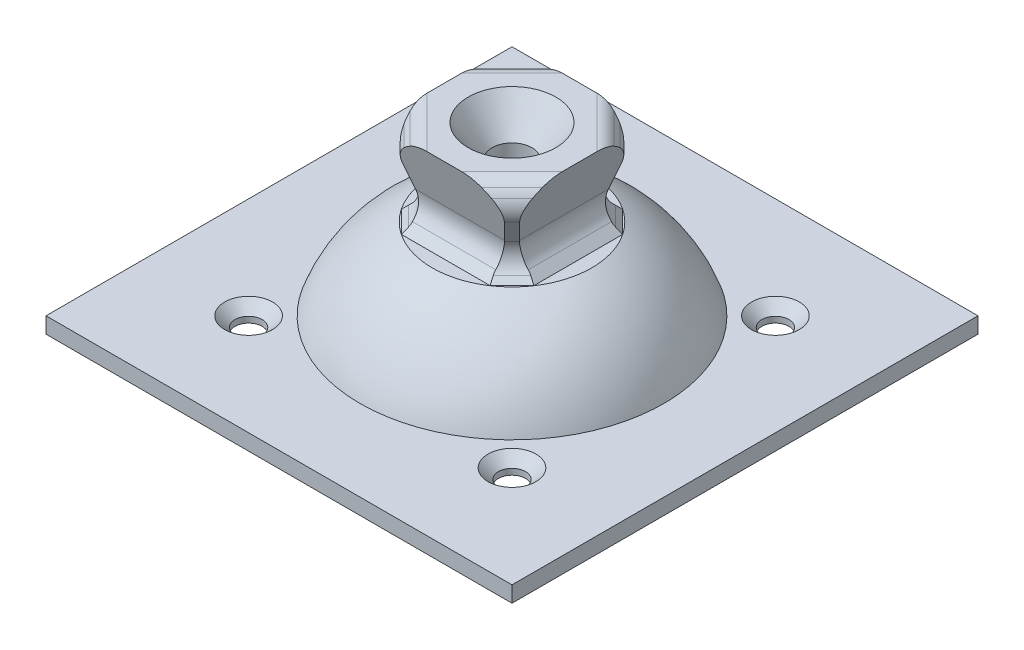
ISO-10303-21;
HEADER;
FILE_DESCRIPTION(('STEP AP214'),'2;1');
FILE_NAME('part.step','',(''),(''),'','','');
FILE_SCHEMA(('AUTOMOTIVE_DESIGN { 1 0 10303 214 1 1 1 1 }'));
ENDSEC;
DATA;
#1=APPLICATION_CONTEXT('core data for automotive mechanical design processes');
#2=APPLICATION_PROTOCOL_DEFINITION('international standard','automotive_design',2000,#1);
#3=PRODUCT_CONTEXT('',#1,'mechanical');
#4=PRODUCT('Part','Part','',(#3));
#5=PRODUCT_RELATED_PRODUCT_CATEGORY('part','',(#4));
#6=PRODUCT_DEFINITION_FORMATION('','',#4);
#7=PRODUCT_DEFINITION_CONTEXT('part definition',#1,'design');
#8=PRODUCT_DEFINITION('design','',#6,#7);
#9=PRODUCT_DEFINITION_SHAPE('','',#8);
#10=(LENGTH_UNIT() NAMED_UNIT(*) SI_UNIT(.MILLI.,.METRE.));
#11=(NAMED_UNIT(*) PLANE_ANGLE_UNIT() SI_UNIT($,.RADIAN.));
#12=(NAMED_UNIT(*) SI_UNIT($,.STERADIAN.) SOLID_ANGLE_UNIT());
#13=UNCERTAINTY_MEASURE_WITH_UNIT(LENGTH_MEASURE(1.E-05),#10,'distance_accuracy_value','');
#14=(GEOMETRIC_REPRESENTATION_CONTEXT(3) GLOBAL_UNCERTAINTY_ASSIGNED_CONTEXT((#13)) GLOBAL_UNIT_ASSIGNED_CONTEXT((#10,
#11,#12)) REPRESENTATION_CONTEXT('',''));
#15=CARTESIAN_POINT('',(0.,0.,0.));
#16=DIRECTION('',(0.,0.,1.));
#17=DIRECTION('',(1.,0.,0.));
#18=AXIS2_PLACEMENT_3D('',#15,#16,#17);
#19=CARTESIAN_POINT('',(-13.5,-5.5,-8.5));
#20=DIRECTION('',(0.,-0.707106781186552,0.707106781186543));
#21=DIRECTION('',(0.,-0.707106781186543,-0.707106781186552));
#22=AXIS2_PLACEMENT_3D('',#19,#20,#21);
#23=PLANE('',#22);
#24=DIRECTION('',(1.,0.,0.));
#25=VECTOR('',#24,1.);
#26=CARTESIAN_POINT('',(-13.5,-5.3,-8.3));
#27=LINE('',#26,#25);
#28=CARTESIAN_POINT('',(-5.55929291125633,-5.3,-8.3));
#29=VERTEX_POINT('',#28);
#30=CARTESIAN_POINT('',(5.55929291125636,-5.3,-8.3));
#31=VERTEX_POINT('',#30);
#32=EDGE_CURVE('E380',#29,#31,#27,.T.);
#33=ORIENTED_EDGE('',*,*,#32,.F.);
#34=DIRECTION('',(0.281084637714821,0.678598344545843,0.678598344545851));
#35=VECTOR('',#34,1.);
#36=CARTESIAN_POINT('',(-6.26297427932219,-6.99883710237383,-9.99883710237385));
#37=LINE('',#36,#35);
#38=CARTESIAN_POINT('',(-5.29399868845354,-4.65952308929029,-7.65952308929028));
#39=VERTEX_POINT('',#38);
#40=EDGE_CURVE('E587',#29,#39,#37,.T.);
#41=ORIENTED_EDGE('',*,*,#40,.T.);
#42=CARTESIAN_POINT('',(-10.4153190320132,-2.53820274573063,-5.53820274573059));
#43=DIRECTION('',(0.,-0.707106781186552,0.707106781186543));
#44=DIRECTION('',(0.816496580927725,-0.408248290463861,-0.408248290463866));
#45=AXIS2_PLACEMENT_3D('',#42,#43,#44);
#46=ELLIPSE('',#45,6.00000000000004,3.);
#47=CARTESIAN_POINT('',(-5.21921853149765,-4.25928596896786,-7.25928596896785));
#48=VERTEX_POINT('',#47);
#49=EDGE_CURVE('E588',#39,#48,#46,.T.);
#50=ORIENTED_EDGE('',*,*,#49,.T.);
#51=DIRECTION('',(1.,0.,0.));
#52=VECTOR('',#51,1.);
#53=CARTESIAN_POINT('',(-13.5,-4.25928596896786,-7.25928596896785));
#54=LINE('',#53,#52);
#55=CARTESIAN_POINT('',(5.21921853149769,-4.25928596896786,-7.25928596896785));
#56=VERTEX_POINT('',#55);
#57=EDGE_CURVE('E743',#48,#56,#54,.T.);
#58=ORIENTED_EDGE('',*,*,#57,.T.);
#59=CARTESIAN_POINT('',(10.4153190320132,-2.53820274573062,-5.53820274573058));
#60=DIRECTION('',(0.,-0.707106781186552,0.707106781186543));
#61=DIRECTION('',(0.816496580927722,0.408248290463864,0.408248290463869));
#62=AXIS2_PLACEMENT_3D('',#59,#60,#61);
#63=ELLIPSE('',#62,6.,3.);
#64=CARTESIAN_POINT('',(5.29399868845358,-4.65952308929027,-7.65952308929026));
#65=VERTEX_POINT('',#64);
#66=EDGE_CURVE('E562',#56,#65,#63,.T.);
#67=ORIENTED_EDGE('',*,*,#66,.T.);
#68=DIRECTION('',(0.281084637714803,-0.678598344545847,-0.678598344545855));
#69=VECTOR('',#68,1.);
#70=CARTESIAN_POINT('',(4.12974279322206,-1.84876071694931,-4.84876071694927));
#71=LINE('',#70,#69);
#72=EDGE_CURVE('E561',#65,#31,#71,.T.);
#73=ORIENTED_EDGE('',*,*,#72,.T.);
#74=EDGE_LOOP('',(#33,#41,#50,#58,#67,#73));
#75=FACE_BOUND('',#74,.T.);
#76=ADVANCED_FACE('F49',(#75),#23,.F.);
#77=CARTESIAN_POINT('',(-13.5,-5.5,8.5));
#78=DIRECTION('',(0.,-0.707106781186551,-0.707106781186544));
#79=DIRECTION('',(0.,0.707106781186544,-0.707106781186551));
#80=AXIS2_PLACEMENT_3D('',#77,#78,#79);
#81=PLANE('',#80);
#82=DIRECTION('',(-1.,0.,0.));
#83=VECTOR('',#82,1.);
#84=CARTESIAN_POINT('',(-13.5,-5.30000000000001,8.30000000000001));
#85=LINE('',#84,#83);
#86=CARTESIAN_POINT('',(5.55929291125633,-5.30000000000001,8.30000000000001));
#87=VERTEX_POINT('',#86);
#88=CARTESIAN_POINT('',(-5.55929291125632,-5.30000000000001,8.30000000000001));
#89=VERTEX_POINT('',#88);
#90=EDGE_CURVE('E392',#87,#89,#85,.T.);
#91=ORIENTED_EDGE('',*,*,#90,.F.);
#92=DIRECTION('',(-0.281084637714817,0.678598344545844,-0.678598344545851));
#93=VECTOR('',#92,1.);
#94=CARTESIAN_POINT('',(4.12974279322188,-1.84876071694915,4.84876071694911));
#95=LINE('',#94,#93);
#96=CARTESIAN_POINT('',(5.29399868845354,-4.65952308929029,7.65952308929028));
#97=VERTEX_POINT('',#96);
#98=EDGE_CURVE('E478',#87,#97,#95,.T.);
#99=ORIENTED_EDGE('',*,*,#98,.T.);
#100=CARTESIAN_POINT('',(10.4153190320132,-2.53820274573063,5.5382027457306));
#101=DIRECTION('',(0.,-0.707106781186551,-0.707106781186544));
#102=DIRECTION('',(0.816496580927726,0.408248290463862,-0.408248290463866));
#103=AXIS2_PLACEMENT_3D('',#100,#101,#102);
#104=ELLIPSE('',#103,6.00000000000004,3.);
#105=CARTESIAN_POINT('',(5.21921853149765,-4.25928596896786,7.25928596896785));
#106=VERTEX_POINT('',#105);
#107=EDGE_CURVE('E464',#97,#106,#104,.T.);
#108=ORIENTED_EDGE('',*,*,#107,.T.);
#109=DIRECTION('',(1.,0.,0.));
#110=VECTOR('',#109,1.);
#111=CARTESIAN_POINT('',(-13.5,-4.25928596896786,7.25928596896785));
#112=LINE('',#111,#110);
#113=CARTESIAN_POINT('',(-5.21921853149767,-4.25928596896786,7.25928596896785));
#114=VERTEX_POINT('',#113);
#115=EDGE_CURVE('E840',#114,#106,#112,.T.);
#116=ORIENTED_EDGE('',*,*,#115,.F.);
#117=CARTESIAN_POINT('',(-10.4153190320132,-2.53820274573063,5.5382027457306));
#118=DIRECTION('',(0.,-0.707106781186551,-0.707106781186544));
#119=DIRECTION('',(0.816496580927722,-0.408248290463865,0.40824829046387));
#120=AXIS2_PLACEMENT_3D('',#117,#118,#119);
#121=ELLIPSE('',#120,6.00000000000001,3.);
#122=CARTESIAN_POINT('',(-5.29399868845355,-4.65952308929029,7.65952308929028));
#123=VERTEX_POINT('',#122);
#124=EDGE_CURVE('E630',#114,#123,#121,.T.);
#125=ORIENTED_EDGE('',*,*,#124,.T.);
#126=DIRECTION('',(-0.281084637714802,-0.678598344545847,0.678598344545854));
#127=VECTOR('',#126,1.);
#128=CARTESIAN_POINT('',(-6.26297427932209,-6.99883710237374,9.99883710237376));
#129=LINE('',#128,#127);
#130=EDGE_CURVE('E631',#123,#89,#129,.T.);
#131=ORIENTED_EDGE('',*,*,#130,.T.);
#132=EDGE_LOOP('',(#91,#99,#108,#116,#125,#131));
#133=FACE_BOUND('',#132,.T.);
#134=ADVANCED_FACE('F893',(#133),#81,.F.);
#135=CARTESIAN_POINT('',(-8.5,-5.5,-13.5));
#136=DIRECTION('',(0.707106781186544,-0.707106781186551,0.));
#137=DIRECTION('',(0.707106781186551,0.707106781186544,0.));
#138=AXIS2_PLACEMENT_3D('',#135,#136,#137);
#139=PLANE('',#138);
#140=DIRECTION('',(0.,0.,-1.));
#141=VECTOR('',#140,1.);
#142=CARTESIAN_POINT('',(-8.29999999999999,-5.29999999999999,-13.5));
#143=LINE('',#142,#141);
#144=CARTESIAN_POINT('',(-8.30000000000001,-5.30000000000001,5.5592929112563));
#145=VERTEX_POINT('',#144);
#146=CARTESIAN_POINT('',(-8.3,-5.3,-5.55929291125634));
#147=VERTEX_POINT('',#146);
#148=EDGE_CURVE('E376',#145,#147,#143,.T.);
#149=ORIENTED_EDGE('',*,*,#148,.F.);
#150=DIRECTION('',(0.678598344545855,0.678598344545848,-0.281084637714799));
#151=VECTOR('',#150,1.);
#152=CARTESIAN_POINT('',(-4.84876071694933,-1.84876071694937,4.12974279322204));
#153=LINE('',#152,#151);
#154=CARTESIAN_POINT('',(-7.65952308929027,-4.65952308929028,5.29399868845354));
#155=VERTEX_POINT('',#154);
#156=EDGE_CURVE('E890',#145,#155,#153,.T.);
#157=ORIENTED_EDGE('',*,*,#156,.T.);
#158=CARTESIAN_POINT('',(-5.5382027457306,-2.53820274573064,10.4153190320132));
#159=DIRECTION('',(0.707106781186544,-0.707106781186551,0.));
#160=DIRECTION('',(0.408248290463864,0.408248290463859,0.816496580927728));
#161=AXIS2_PLACEMENT_3D('',#158,#159,#160);
#162=ELLIPSE('',#161,6.00000000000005,3.);
#163=CARTESIAN_POINT('',(-7.25931946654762,-4.25931946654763,5.21921821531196));
#164=VERTEX_POINT('',#163);
#165=EDGE_CURVE('E846',#155,#164,#162,.T.);
#166=ORIENTED_EDGE('',*,*,#165,.T.);
#167=DIRECTION('',(0.,0.,1.));
#168=VECTOR('',#167,1.);
#169=CARTESIAN_POINT('',(-7.25931946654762,-4.25931946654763,-13.5));
#170=LINE('',#169,#168);
#171=CARTESIAN_POINT('',(-7.25931946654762,-4.25931946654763,-5.21921821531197));
#172=VERTEX_POINT('',#171);
#173=EDGE_CURVE('E661',#172,#164,#170,.T.);
#174=ORIENTED_EDGE('',*,*,#173,.F.);
#175=CARTESIAN_POINT('',(-5.53820274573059,-2.53820274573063,-10.4153190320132));
#176=DIRECTION('',(0.707106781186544,-0.707106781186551,0.));
#177=DIRECTION('',(0.408248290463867,0.408248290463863,-0.816496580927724));
#178=AXIS2_PLACEMENT_3D('',#175,#176,#177);
#179=ELLIPSE('',#178,6.00000000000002,3.);
#180=CARTESIAN_POINT('',(-7.65952308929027,-4.65952308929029,-5.29399868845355));
#181=VERTEX_POINT('',#180);
#182=EDGE_CURVE('E767',#172,#181,#179,.T.);
#183=ORIENTED_EDGE('',*,*,#182,.T.);
#184=DIRECTION('',(-0.67859834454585,-0.678598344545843,-0.281084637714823));
#185=VECTOR('',#184,1.);
#186=CARTESIAN_POINT('',(-9.99883710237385,-6.99883710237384,-6.26297427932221));
#187=LINE('',#186,#185);
#188=EDGE_CURVE('E761',#181,#147,#187,.T.);
#189=ORIENTED_EDGE('',*,*,#188,.T.);
#190=EDGE_LOOP('',(#149,#157,#166,#174,#183,#189));
#191=FACE_BOUND('',#190,.T.);
#192=ADVANCED_FACE('F883',(#191),#139,.F.);
#193=CARTESIAN_POINT('',(8.5,-5.5,-13.5));
#194=DIRECTION('',(-0.707106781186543,-0.707106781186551,0.));
#195=DIRECTION('',(0.707106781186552,-0.707106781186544,0.));
#196=AXIS2_PLACEMENT_3D('',#193,#194,#195);
#197=PLANE('',#196);
#198=DIRECTION('',(0.,0.,1.));
#199=VECTOR('',#198,1.);
#200=CARTESIAN_POINT('',(8.29999999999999,-5.29999999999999,-13.5));
#201=LINE('',#200,#199);
#202=CARTESIAN_POINT('',(8.29999999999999,-5.3,-5.55929291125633));
#203=VERTEX_POINT('',#202);
#204=CARTESIAN_POINT('',(8.3,-5.30000000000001,5.55929291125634));
#205=VERTEX_POINT('',#204);
#206=EDGE_CURVE('E73',#203,#205,#201,.T.);
#207=ORIENTED_EDGE('',*,*,#206,.F.);
#208=DIRECTION('',(-0.678598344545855,0.678598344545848,0.281084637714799));
#209=VECTOR('',#208,1.);
#210=CARTESIAN_POINT('',(9.99883710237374,-6.99883710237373,-6.26297427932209));
#211=LINE('',#210,#209);
#212=CARTESIAN_POINT('',(7.65952308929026,-4.65952308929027,-5.29399868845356));
#213=VERTEX_POINT('',#212);
#214=EDGE_CURVE('E535',#203,#213,#211,.T.);
#215=ORIENTED_EDGE('',*,*,#214,.T.);
#216=CARTESIAN_POINT('',(5.53820274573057,-2.53820274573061,-10.4153190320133));
#217=DIRECTION('',(-0.707106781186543,-0.707106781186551,0.));
#218=DIRECTION('',(0.408248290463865,-0.40824829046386,0.816496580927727));
#219=AXIS2_PLACEMENT_3D('',#216,#217,#218);
#220=ELLIPSE('',#219,6.00000000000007,3.);
#221=CARTESIAN_POINT('',(7.25931946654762,-4.25931946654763,-5.21921821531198));
#222=VERTEX_POINT('',#221);
#223=EDGE_CURVE('E731',#213,#222,#220,.T.);
#224=ORIENTED_EDGE('',*,*,#223,.T.);
#225=DIRECTION('',(0.,0.,1.));
#226=VECTOR('',#225,1.);
#227=CARTESIAN_POINT('',(7.25931946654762,-4.25931946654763,-13.5));
#228=LINE('',#227,#226);
#229=CARTESIAN_POINT('',(7.25931946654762,-4.25931946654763,5.21921821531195));
#230=VERTEX_POINT('',#229);
#231=EDGE_CURVE('E653',#222,#230,#228,.T.);
#232=ORIENTED_EDGE('',*,*,#231,.T.);
#233=CARTESIAN_POINT('',(5.53820274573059,-2.53820274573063,10.4153190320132));
#234=DIRECTION('',(-0.707106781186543,-0.707106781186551,0.));
#235=DIRECTION('',(0.408248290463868,-0.408248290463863,-0.816496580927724));
#236=AXIS2_PLACEMENT_3D('',#233,#234,#235);
#237=ELLIPSE('',#236,6.00000000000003,3.);
#238=CARTESIAN_POINT('',(7.65952308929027,-4.65952308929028,5.29399868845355));
#239=VERTEX_POINT('',#238);
#240=EDGE_CURVE('E460',#230,#239,#237,.T.);
#241=ORIENTED_EDGE('',*,*,#240,.T.);
#242=DIRECTION('',(0.678598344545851,-0.678598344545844,0.281084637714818));
#243=VECTOR('',#242,1.);
#244=CARTESIAN_POINT('',(4.8487607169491,-1.84876071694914,4.12974279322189));
#245=LINE('',#244,#243);
#246=EDGE_CURVE('E508',#239,#205,#245,.T.);
#247=ORIENTED_EDGE('',*,*,#246,.T.);
#248=EDGE_LOOP('',(#207,#215,#224,#232,#241,#247));
#249=FACE_BOUND('',#248,.T.);
#250=ADVANCED_FACE('F520',(#249),#197,.F.);
#251=CARTESIAN_POINT('',(-2.47487373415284,-5.49999999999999,-16.6170093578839));
#252=DIRECTION('',(-0.500000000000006,-0.707106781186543,0.5));
#253=DIRECTION('',(0.816496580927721,-0.577350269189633,0.));
#254=AXIS2_PLACEMENT_3D('',#251,#252,#253);
#255=PLANE('',#254);
#256=DIRECTION('',(0.707106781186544,0.,0.707106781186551));
#257=VECTOR('',#256,1.);
#258=CARTESIAN_POINT('',(-2.61629509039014,-5.29999999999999,-16.4755880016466));
#259=LINE('',#258,#257);
#260=EDGE_CURVE('E65',#31,#203,#259,.T.);
#261=ORIENTED_EDGE('',*,*,#260,.F.);
#262=ORIENTED_EDGE('',*,*,#72,.F.);
#263=DIRECTION('',(0.707106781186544,0.,0.707106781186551));
#264=VECTOR('',#263,1.);
#265=CARTESIAN_POINT('',(-3.0691806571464,-4.65952308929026,-16.0227024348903));
#266=LINE('',#265,#264);
#267=EDGE_CURVE('E699',#65,#213,#266,.T.);
#268=ORIENTED_EDGE('',*,*,#267,.T.);
#269=ORIENTED_EDGE('',*,*,#214,.F.);
#270=EDGE_LOOP('',(#261,#262,#268,#269));
#271=FACE_BOUND('',#270,.T.);
#272=ADVANCED_FACE('F546',(#271),#255,.F.);
#273=CARTESIAN_POINT('',(-16.6170093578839,-5.5,-2.474873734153));
#274=DIRECTION('',(0.500000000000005,-0.707106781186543,-0.500000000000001));
#275=DIRECTION('',(0.816496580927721,0.577350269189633,0.));
#276=AXIS2_PLACEMENT_3D('',#273,#274,#275);
#277=PLANE('',#276);
#278=DIRECTION('',(-0.707106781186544,0.,-0.707106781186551));
#279=VECTOR('',#278,1.);
#280=CARTESIAN_POINT('',(-16.4755880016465,-5.3,-2.61629509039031));
#281=LINE('',#280,#279);
#282=EDGE_CURVE('E384',#89,#145,#281,.T.);
#283=ORIENTED_EDGE('',*,*,#282,.F.);
#284=ORIENTED_EDGE('',*,*,#130,.F.);
#285=DIRECTION('',(0.707106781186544,0.,0.707106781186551));
#286=VECTOR('',#285,1.);
#287=CARTESIAN_POINT('',(-16.0227024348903,-4.65952308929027,-3.06918065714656));
#288=LINE('',#287,#286);
#289=EDGE_CURVE('E710',#155,#123,#288,.T.);
#290=ORIENTED_EDGE('',*,*,#289,.F.);
#291=ORIENTED_EDGE('',*,*,#156,.F.);
#292=EDGE_LOOP('',(#283,#284,#290,#291));
#293=FACE_BOUND('',#292,.T.);
#294=ADVANCED_FACE('F642',(#293),#277,.F.);
#295=CARTESIAN_POINT('',(-2.47487373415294,-5.5,16.6170093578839));
#296=DIRECTION('',(-0.499999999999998,-0.70710678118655,-0.499999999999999));
#297=DIRECTION('',(0.,0.577350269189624,-0.816496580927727));
#298=AXIS2_PLACEMENT_3D('',#295,#296,#297);
#299=PLANE('',#298);
#300=DIRECTION('',(-0.707106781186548,0.,0.707106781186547));
#301=VECTOR('',#300,1.);
#302=CARTESIAN_POINT('',(-2.61629509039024,-5.30000000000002,16.4755880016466));
#303=LINE('',#302,#301);
#304=EDGE_CURVE('E396',#205,#87,#303,.T.);
#305=ORIENTED_EDGE('',*,*,#304,.F.);
#306=ORIENTED_EDGE('',*,*,#246,.F.);
#307=DIRECTION('',(0.707106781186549,0.,-0.707106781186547));
#308=VECTOR('',#307,1.);
#309=CARTESIAN_POINT('',(-3.06918065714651,-4.65952308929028,16.0227024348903));
#310=LINE('',#309,#308);
#311=EDGE_CURVE('E408',#97,#239,#310,.T.);
#312=ORIENTED_EDGE('',*,*,#311,.F.);
#313=ORIENTED_EDGE('',*,*,#98,.F.);
#314=EDGE_LOOP('',(#305,#306,#312,#313));
#315=FACE_BOUND('',#314,.T.);
#316=ADVANCED_FACE('F494',(#315),#299,.F.);
#317=CARTESIAN_POINT('',(-16.6170093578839,-5.5,2.47487373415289));
#318=DIRECTION('',(0.499999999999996,-0.707106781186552,0.499999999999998));
#319=DIRECTION('',(0.,-0.577350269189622,-0.816496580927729));
#320=AXIS2_PLACEMENT_3D('',#317,#318,#319);
#321=PLANE('',#320);
#322=DIRECTION('',(0.707106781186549,0.,-0.707106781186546));
#323=VECTOR('',#322,1.);
#324=CARTESIAN_POINT('',(-16.4755880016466,-5.30000000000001,2.6162950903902));
#325=LINE('',#324,#323);
#326=EDGE_CURVE('E372',#147,#29,#325,.T.);
#327=ORIENTED_EDGE('',*,*,#326,.F.);
#328=ORIENTED_EDGE('',*,*,#188,.F.);
#329=DIRECTION('',(0.707106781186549,0.,-0.707106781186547));
#330=VECTOR('',#329,1.);
#331=CARTESIAN_POINT('',(-16.0227024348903,-4.65952308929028,3.06918065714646));
#332=LINE('',#331,#330);
#333=EDGE_CURVE('E430',#181,#39,#332,.T.);
#334=ORIENTED_EDGE('',*,*,#333,.T.);
#335=ORIENTED_EDGE('',*,*,#40,.F.);
#336=EDGE_LOOP('',(#327,#328,#334,#335));
#337=FACE_BOUND('',#336,.T.);
#338=ADVANCED_FACE('F598',(#337),#321,.F.);
#339=CARTESIAN_POINT('',(0.,-5.5,0.));
#340=DIRECTION('',(0.,-1.,0.));
#341=DIRECTION('',(0.,0.,-1.));
#342=AXIS2_PLACEMENT_3D('',#339,#340,#341);
#343=CYLINDRICAL_SURFACE('',#342,2.5);
#344=CARTESIAN_POINT('',(0.,1.5,0.));
#345=DIRECTION('',(0.,-1.,0.));
#346=DIRECTION('',(0.,0.,-1.));
#347=AXIS2_PLACEMENT_3D('',#344,#345,#346);
#348=CIRCLE('',#347,2.5);
#349=CARTESIAN_POINT('',(0.,1.5,-2.5));
#350=VERTEX_POINT('',#349);
#351=EDGE_CURVE('E400',#350,#350,#348,.T.);
#352=ORIENTED_EDGE('',*,*,#351,.F.);
#353=EDGE_LOOP('',(#352));
#354=FACE_BOUND('',#353,.T.);
#355=CARTESIAN_POINT('',(0.,-5.3,0.));
#356=DIRECTION('',(0.,-1.,0.));
#357=DIRECTION('',(0.,0.,-1.));
#358=AXIS2_PLACEMENT_3D('',#355,#356,#357);
#359=CIRCLE('',#358,2.5);
#360=CARTESIAN_POINT('',(0.,-5.3,-2.5));
#361=VERTEX_POINT('',#360);
#362=EDGE_CURVE('E11',#361,#361,#359,.F.);
#363=ORIENTED_EDGE('',*,*,#362,.F.);
#364=EDGE_LOOP('',(#363));
#365=FACE_BOUND('',#364,.T.);
#366=ADVANCED_FACE('F997',(#354,#365),#343,.F.);
#367=CARTESIAN_POINT('',(-8.5,5.5,8.5));
#368=DIRECTION('',(0.,-1.,0.));
#369=DIRECTION('',(0.,0.,-1.));
#370=AXIS2_PLACEMENT_3D('',#367,#368,#369);
#371=PLANE('',#370);
#372=CARTESIAN_POINT('',(0.,5.5,0.));
#373=DIRECTION('',(0.,-1.,0.));
#374=DIRECTION('',(0.,0.,-1.));
#375=AXIS2_PLACEMENT_3D('',#372,#373,#374);
#376=CIRCLE('',#375,5.5);
#377=CARTESIAN_POINT('',(0.,5.5,-5.5));
#378=VERTEX_POINT('',#377);
#379=EDGE_CURVE('E404',#378,#378,#376,.T.);
#380=ORIENTED_EDGE('',*,*,#379,.T.);
#381=EDGE_LOOP('',(#380));
#382=FACE_BOUND('',#381,.T.);
#383=DIRECTION('',(0.,0.,-1.));
#384=VECTOR('',#383,1.);
#385=CARTESIAN_POINT('',(8.5,5.5,8.5));
#386=LINE('',#385,#384);
#387=CARTESIAN_POINT('',(8.5,5.5,2.16583557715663));
#388=VERTEX_POINT('',#387);
#389=CARTESIAN_POINT('',(8.5,5.5,-2.16583557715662));
#390=VERTEX_POINT('',#389);
#391=EDGE_CURVE('E668',#388,#390,#386,.T.);
#392=ORIENTED_EDGE('',*,*,#391,.T.);
#393=DIRECTION('',(0.707106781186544,0.,0.707106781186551));
#394=VECTOR('',#393,1.);
#395=CARTESIAN_POINT('',(5.33291778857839,5.5,-5.33291778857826));
#396=LINE('',#395,#394);
#397=CARTESIAN_POINT('',(2.16583557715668,5.5,-8.5));
#398=VERTEX_POINT('',#397);
#399=EDGE_CURVE('E785',#390,#398,#396,.F.);
#400=ORIENTED_EDGE('',*,*,#399,.T.);
#401=DIRECTION('',(-1.,0.,0.));
#402=VECTOR('',#401,1.);
#403=CARTESIAN_POINT('',(-8.5,5.5,-8.5));
#404=LINE('',#403,#402);
#405=CARTESIAN_POINT('',(-2.16583557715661,5.5,-8.5));
#406=VERTEX_POINT('',#405);
#407=EDGE_CURVE('E832',#398,#406,#404,.T.);
#408=ORIENTED_EDGE('',*,*,#407,.T.);
#409=DIRECTION('',(0.707106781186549,0.,-0.707106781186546));
#410=VECTOR('',#409,1.);
#411=CARTESIAN_POINT('',(-13.8329177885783,5.5,3.16708221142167));
#412=LINE('',#411,#410);
#413=CARTESIAN_POINT('',(-8.5,5.5,-2.16583557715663));
#414=VERTEX_POINT('',#413);
#415=EDGE_CURVE('E782',#406,#414,#412,.F.);
#416=ORIENTED_EDGE('',*,*,#415,.T.);
#417=DIRECTION('',(0.,0.,-1.));
#418=VECTOR('',#417,1.);
#419=CARTESIAN_POINT('',(-8.5,5.5,8.5));
#420=LINE('',#419,#418);
#421=CARTESIAN_POINT('',(-8.5,5.5,2.1658355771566));
#422=VERTEX_POINT('',#421);
#423=EDGE_CURVE('E825',#422,#414,#420,.T.);
#424=ORIENTED_EDGE('',*,*,#423,.F.);
#425=DIRECTION('',(0.707106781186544,0.,0.707106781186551));
#426=VECTOR('',#425,1.);
#427=CARTESIAN_POINT('',(-5.3329177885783,5.5,5.33291778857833));
#428=LINE('',#427,#426);
#429=CARTESIAN_POINT('',(-2.16583557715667,5.5,8.5));
#430=VERTEX_POINT('',#429);
#431=EDGE_CURVE('E778',#422,#430,#428,.T.);
#432=ORIENTED_EDGE('',*,*,#431,.T.);
#433=DIRECTION('',(-1.,0.,0.));
#434=VECTOR('',#433,1.);
#435=CARTESIAN_POINT('',(-8.5,5.5,8.5));
#436=LINE('',#435,#434);
#437=CARTESIAN_POINT('',(2.16583557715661,5.5,8.5));
#438=VERTEX_POINT('',#437);
#439=EDGE_CURVE('E823',#438,#430,#436,.T.);
#440=ORIENTED_EDGE('',*,*,#439,.F.);
#441=DIRECTION('',(0.707106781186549,0.,-0.707106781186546));
#442=VECTOR('',#441,1.);
#443=CARTESIAN_POINT('',(-3.16708221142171,5.5,13.8329177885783));
#444=LINE('',#443,#442);
#445=EDGE_CURVE('E774',#438,#388,#444,.T.);
#446=ORIENTED_EDGE('',*,*,#445,.T.);
#447=EDGE_LOOP('',(#392,#400,#408,#416,#424,#432,#440,#446));
#448=FACE_BOUND('',#447,.T.);
#449=ADVANCED_FACE('F571',(#382,#448),#371,.F.);
#450=CARTESIAN_POINT('',(-13.5,-2.13796562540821,-9.38060631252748));
#451=DIRECTION('',(1.,0.,0.));
#452=DIRECTION('',(0.,0.,-1.));
#453=AXIS2_PLACEMENT_3D('',#450,#451,#452);
#454=CYLINDRICAL_SURFACE('',#453,3.);
#455=ORIENTED_EDGE('',*,*,#57,.F.);
#456=CARTESIAN_POINT('',(-5.21921853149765,-4.25928596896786,-7.25928596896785));
#457=CARTESIAN_POINT('',(-5.2197489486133,-4.20037458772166,-7.20036228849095));
#458=CARTESIAN_POINT('',(-5.21991383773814,-4.13899677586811,-7.14390541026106));
#459=CARTESIAN_POINT('',(-5.22018504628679,-4.01175464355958,-7.03628454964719));
#460=CARTESIAN_POINT('',(-5.22029136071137,-3.94588994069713,-6.9851210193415));
#461=CARTESIAN_POINT('',(-5.2211181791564,-3.81010858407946,-6.88844065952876));
#462=CARTESIAN_POINT('',(-5.22183888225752,-3.74019062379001,-6.84292566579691));
#463=CARTESIAN_POINT('',(-5.22441546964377,-3.59682641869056,-6.75788447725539));
#464=CARTESIAN_POINT('',(-5.22627128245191,-3.52338039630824,-6.71835790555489));
#465=CARTESIAN_POINT('',(-5.23156344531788,-3.37339538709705,-6.64552445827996));
#466=CARTESIAN_POINT('',(-5.23500193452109,-3.29685234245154,-6.61222608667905));
#467=CARTESIAN_POINT('',(-5.24382932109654,-3.14132538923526,-6.55214009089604));
#468=CARTESIAN_POINT('',(-5.24921895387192,-3.0623405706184,-6.52535492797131));
#469=CARTESIAN_POINT('',(-5.26225000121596,-2.9026472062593,-6.4785069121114));
#470=CARTESIAN_POINT('',(-5.2698897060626,-2.82194001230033,-6.45843897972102));
#471=CARTESIAN_POINT('',(-5.28767748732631,-2.65937651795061,-6.4251000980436));
#472=CARTESIAN_POINT('',(-5.29782636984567,-2.5775198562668,-6.41183133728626));
#473=CARTESIAN_POINT('',(-5.32049749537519,-2.41578222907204,-6.39242023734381));
#474=CARTESIAN_POINT('',(-5.33294117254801,-2.33591394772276,-6.38607981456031));
#475=CARTESIAN_POINT('',(-5.36053465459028,-2.17639363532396,-6.37979076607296));
#476=CARTESIAN_POINT('',(-5.37568440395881,-2.09674159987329,-6.37984200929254));
#477=CARTESIAN_POINT('',(-5.40878568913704,-1.93840248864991,-6.38620409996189));
#478=CARTESIAN_POINT('',(-5.42673304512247,-1.85971415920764,-6.39250568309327));
#479=CARTESIAN_POINT('',(-5.46553854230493,-1.70381945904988,-6.41114958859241));
#480=CARTESIAN_POINT('',(-5.48639498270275,-1.62661225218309,-6.42348839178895));
#481=CARTESIAN_POINT('',(-5.51545841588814,-1.52756123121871,-6.44326869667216));
#482=CARTESIAN_POINT('',(-5.52230808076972,-1.50476999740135,-6.44809806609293));
#483=CARTESIAN_POINT('',(-5.53627212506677,-1.45941233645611,-6.45826060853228));
#484=CARTESIAN_POINT('',(-5.54338618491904,-1.43684567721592,-6.46359318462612));
#485=CARTESIAN_POINT('',(-5.55063811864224,-1.41438296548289,-6.46917571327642));
#486=B_SPLINE_CURVE_WITH_KNOTS('',3,(#456,#457,#458,#459,#460,#461,#462,#463,#464,#465,#466,
#467,#468,#469,#470,#471,#472,#473,#474,#475,#476,#477,#478,#479,#480,#481,#482,#483,#484,#485),
.UNSPECIFIED.,.F.,.F.,(4,2,2,2,2,2,2,2,2,2,2,2,2,2,4),(0.,0.249894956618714,0.499811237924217,
0.749808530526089,0.99979008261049,1.25011050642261,1.50052537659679,1.75075045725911,
2.0010560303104,2.24400120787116,2.48694140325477,2.72952204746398,2.97196145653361,
3.04480635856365,3.11756590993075),.UNSPECIFIED.);
#487=CARTESIAN_POINT('',(-5.55063811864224,-1.41438296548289,-6.46917571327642));
#488=VERTEX_POINT('',#487);
#489=EDGE_CURVE('E577',#48,#488,#486,.T.);
#490=ORIENTED_EDGE('',*,*,#489,.T.);
#491=CARTESIAN_POINT('',(-2.22576731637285,-2.13796562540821,-9.38060631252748));
#492=DIRECTION('',(0.655617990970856,0.374606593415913,0.655617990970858));
#493=DIRECTION('',(0.755092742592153,-0.325256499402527,-0.569247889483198));
#494=AXIS2_PLACEMENT_3D('',#491,#492,#493);
#495=ELLIPSE('',#494,4.57583538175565,3.);
#496=CARTESIAN_POINT('',(-5.58753586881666,-1.29146665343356,-6.50250980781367));
#497=VERTEX_POINT('',#496);
#498=EDGE_CURVE('E982',#488,#497,#495,.F.);
#499=ORIENTED_EDGE('',*,*,#498,.T.);
#500=DIRECTION('',(1.,0.,0.));
#501=VECTOR('',#500,1.);
#502=CARTESIAN_POINT('',(-13.5,-1.29146665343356,-6.50250980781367));
#503=LINE('',#502,#501);
#504=CARTESIAN_POINT('',(5.58753586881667,-1.29146665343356,-6.50250980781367));
#505=VERTEX_POINT('',#504);
#506=EDGE_CURVE('E749',#497,#505,#503,.T.);
#507=ORIENTED_EDGE('',*,*,#506,.T.);
#508=CARTESIAN_POINT('',(2.2257673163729,-2.13796562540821,-9.38060631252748));
#509=DIRECTION('',(-0.65561799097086,0.374606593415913,0.655617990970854));
#510=DIRECTION('',(0.755092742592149,0.325256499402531,0.5692478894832));
#511=AXIS2_PLACEMENT_3D('',#508,#509,#510);
#512=ELLIPSE('',#511,4.57583538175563,3.);
#513=CARTESIAN_POINT('',(5.55063811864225,-1.41438296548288,-6.46917571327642));
#514=VERTEX_POINT('',#513);
#515=EDGE_CURVE('E723',#505,#514,#512,.F.);
#516=ORIENTED_EDGE('',*,*,#515,.T.);
#517=CARTESIAN_POINT('',(5.55063811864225,-1.41438296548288,-6.46917571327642));
#518=CARTESIAN_POINT('',(5.52657860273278,-1.48889664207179,-6.45064194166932));
#519=CARTESIAN_POINT('',(5.5040317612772,-1.56459175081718,-6.43488128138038));
#520=CARTESIAN_POINT('',(5.4618760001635,-1.71776834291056,-6.4091684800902));
#521=CARTESIAN_POINT('',(5.44226719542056,-1.79524989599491,-6.39921656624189));
#522=CARTESIAN_POINT('',(5.40593044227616,-1.95129460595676,-6.38539588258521));
#523=CARTESIAN_POINT('',(5.38919802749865,-2.02985587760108,-6.38151760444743));
#524=CARTESIAN_POINT('',(5.35847272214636,-2.18756858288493,-6.37998028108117));
#525=CARTESIAN_POINT('',(5.34447968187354,-2.26671998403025,-6.3823208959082));
#526=CARTESIAN_POINT('',(5.31909348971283,-2.42506408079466,-6.39332020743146));
#527=CARTESIAN_POINT('',(5.3077023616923,-2.50425676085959,-6.40198380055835));
#528=CARTESIAN_POINT('',(5.28737004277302,-2.66203366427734,-6.42565818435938));
#529=CARTESIAN_POINT('',(5.27842971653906,-2.74061766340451,-6.44067121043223));
#530=CARTESIAN_POINT('',(5.26280710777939,-2.89654274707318,-6.47699324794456));
#531=CARTESIAN_POINT('',(5.25612478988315,-2.97388385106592,-6.49830216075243));
#532=CARTESIAN_POINT('',(5.24477821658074,-3.12674329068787,-6.54710038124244));
#533=CARTESIAN_POINT('',(5.24011401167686,-3.2022615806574,-6.5745898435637));
#534=CARTESIAN_POINT('',(5.23251549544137,-3.35093120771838,-6.63557964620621));
#535=CARTESIAN_POINT('',(5.22958143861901,-3.4240821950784,-6.66908086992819));
#536=CARTESIAN_POINT('',(5.22510149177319,-3.56746603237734,-6.74185845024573));
#537=CARTESIAN_POINT('',(5.22355515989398,-3.63769980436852,-6.78113296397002));
#538=CARTESIAN_POINT('',(5.22144082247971,-3.77472610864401,-6.86516018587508));
#539=CARTESIAN_POINT('',(5.22087186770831,-3.84152191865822,-6.90990753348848));
#540=CARTESIAN_POINT('',(5.22022216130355,-3.97128240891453,-7.00460220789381));
#541=CARTESIAN_POINT('',(5.22014116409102,-4.03424900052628,-7.05454690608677));
#542=CARTESIAN_POINT('',(5.21994635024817,-4.12342099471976,-7.13130311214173));
#543=CARTESIAN_POINT('',(5.21987321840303,-4.15128562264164,-7.15620991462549));
#544=CARTESIAN_POINT('',(5.21963350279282,-4.20602441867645,-7.20700917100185));
#545=CARTESIAN_POINT('',(5.21946705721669,-4.23289998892,-7.23290011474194));
#546=CARTESIAN_POINT('',(5.21921853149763,-4.25928596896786,-7.25928596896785));
#547=B_SPLINE_CURVE_WITH_KNOTS('',3,(#517,#518,#519,#520,#521,#522,#523,#524,#525,#526,#527,
#528,#529,#530,#531,#532,#533,#534,#535,#536,#537,#538,#539,#540,#541,#542,#543,#544,#545,#546),
.UNSPECIFIED.,.F.,.F.,(4,2,2,2,2,2,2,2,2,2,2,2,2,2,4),(0.,0.241330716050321,0.482670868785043,
0.723632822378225,0.964581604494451,1.20571717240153,1.44693770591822,1.68815446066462,
1.92937725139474,2.1706355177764,2.41181693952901,2.65276399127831,2.89358976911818,
3.00568873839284,3.11762213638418),.UNSPECIFIED.);
#548=EDGE_CURVE('E551',#514,#56,#547,.T.);
#549=ORIENTED_EDGE('',*,*,#548,.T.);
#550=EDGE_LOOP('',(#455,#490,#499,#507,#516,#549));
#551=FACE_BOUND('',#550,.T.);
#552=ADVANCED_FACE('F565',(#551),#454,.F.);
#553=CARTESIAN_POINT('',(-13.5,5.5,-8.5));
#554=DIRECTION('',(0.,0.282166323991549,0.959365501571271));
#555=DIRECTION('',(0.,-0.959365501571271,0.282166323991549));
#556=AXIS2_PLACEMENT_3D('',#553,#554,#555);
#557=PLANE('',#556);
#558=ORIENTED_EDGE('',*,*,#407,.F.);
#559=CARTESIAN_POINT('',(2.75407087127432,3.49999999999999,-7.91176470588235));
#560=DIRECTION('',(0.,0.282166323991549,0.959365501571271));
#561=DIRECTION('',(0.962420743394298,-0.260527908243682,0.0766258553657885));
#562=AXIS2_PLACEMENT_3D('',#559,#560,#561);
#563=ELLIPSE('',#562,2.94822684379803,2.);
#564=CARTESIAN_POINT('',(4.47092343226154,4.83280444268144,-8.30376601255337));
#565=VERTEX_POINT('',#564);
#566=EDGE_CURVE('E755',#398,#565,#563,.F.);
#567=ORIENTED_EDGE('',*,*,#566,.T.);
#568=CARTESIAN_POINT('',(1.20829040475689,2.30000000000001,-7.55882352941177));
#569=DIRECTION('',(0.,0.282166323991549,0.959365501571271));
#570=DIRECTION('',(0.962420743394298,-0.260527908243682,0.0766258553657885));
#571=AXIS2_PLACEMENT_3D('',#568,#569,#570);
#572=ELLIPSE('',#571,5.60268394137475,3.80071428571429);
#573=CARTESIAN_POINT('',(5.48226566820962,4.03306924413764,-8.06854977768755));
#574=VERTEX_POINT('',#573);
#575=EDGE_CURVE('E727',#565,#574,#572,.F.);
#576=ORIENTED_EDGE('',*,*,#575,.T.);
#577=CARTESIAN_POINT('',(2.10870879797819,2.66511381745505,-7.66620994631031));
#578=DIRECTION('',(0.,0.282166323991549,0.959365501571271));
#579=DIRECTION('',(0.962420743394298,-0.260527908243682,0.0766258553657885));
#580=AXIS2_PLACEMENT_3D('',#577,#578,#579);
#581=ELLIPSE('',#580,4.42234026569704,3.);
#582=CARTESIAN_POINT('',(6.37295197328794,1.54129403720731,-7.33567471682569));
#583=VERTEX_POINT('',#582);
#584=EDGE_CURVE('E696',#574,#583,#581,.F.);
#585=ORIENTED_EDGE('',*,*,#584,.T.);
#586=DIRECTION('',(-0.257056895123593,-0.927127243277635,0.27268448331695));
#587=VECTOR('',#586,1.);
#588=CARTESIAN_POINT('',(6.08485243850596,0.50220528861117,-7.03006037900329));
#589=LINE('',#588,#587);
#590=EDGE_CURVE('E704',#583,#505,#589,.T.);
#591=ORIENTED_EDGE('',*,*,#590,.T.);
#592=ORIENTED_EDGE('',*,*,#506,.F.);
#593=DIRECTION('',(-0.257056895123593,0.927127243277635,-0.27268448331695));
#594=VECTOR('',#593,1.);
#595=CARTESIAN_POINT('',(-7.86896511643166,6.93696545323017,-8.92263689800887));
#596=LINE('',#595,#594);
#597=CARTESIAN_POINT('',(-6.37295197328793,1.5412940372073,-7.33567471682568));
#598=VERTEX_POINT('',#597);
#599=EDGE_CURVE('E985',#497,#598,#596,.T.);
#600=ORIENTED_EDGE('',*,*,#599,.T.);
#601=CARTESIAN_POINT('',(-2.10870879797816,2.66511381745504,-7.66620994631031));
#602=DIRECTION('',(0.,0.282166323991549,0.959365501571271));
#603=DIRECTION('',(0.962420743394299,0.260527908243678,-0.0766258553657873));
#604=AXIS2_PLACEMENT_3D('',#601,#602,#603);
#605=ELLIPSE('',#604,4.42234026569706,3.);
#606=CARTESIAN_POINT('',(-5.48226566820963,4.0330692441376,-8.06854977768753));
#607=VERTEX_POINT('',#606);
#608=EDGE_CURVE('E610',#598,#607,#605,.F.);
#609=ORIENTED_EDGE('',*,*,#608,.T.);
#610=CARTESIAN_POINT('',(-1.2082904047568,2.29999999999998,-7.55882352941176));
#611=DIRECTION('',(0.,0.282166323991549,0.959365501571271));
#612=DIRECTION('',(0.962420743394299,0.260527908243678,-0.0766258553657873));
#613=AXIS2_PLACEMENT_3D('',#610,#611,#612);
#614=ELLIPSE('',#613,5.60268394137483,3.80071428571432);
#615=CARTESIAN_POINT('',(-4.47092343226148,4.83280444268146,-8.30376601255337));
#616=VERTEX_POINT('',#615);
#617=EDGE_CURVE('E980',#607,#616,#614,.F.);
#618=ORIENTED_EDGE('',*,*,#617,.T.);
#619=CARTESIAN_POINT('',(-2.75407087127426,3.5,-7.91176470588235));
#620=DIRECTION('',(0.,0.282166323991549,0.959365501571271));
#621=DIRECTION('',(0.962420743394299,0.260527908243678,-0.0766258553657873));
#622=AXIS2_PLACEMENT_3D('',#619,#620,#621);
#623=ELLIPSE('',#622,2.94822684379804,2.);
#624=EDGE_CURVE('E788',#616,#406,#623,.F.);
#625=ORIENTED_EDGE('',*,*,#624,.T.);
#626=EDGE_LOOP('',(#558,#567,#576,#585,#591,#592,#600,#609,#618,#625));
#627=FACE_BOUND('',#626,.T.);
#628=ADVANCED_FACE('F570',(#627),#557,.F.);
#629=CARTESIAN_POINT('',(-13.5,-2.13796562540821,9.38060631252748));
#630=DIRECTION('',(1.,0.,0.));
#631=DIRECTION('',(0.,0.,-1.));
#632=AXIS2_PLACEMENT_3D('',#629,#630,#631);
#633=CYLINDRICAL_SURFACE('',#632,3.);
#634=CARTESIAN_POINT('',(5.21921853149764,-4.25928596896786,7.25928596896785));
#635=CARTESIAN_POINT('',(5.2197489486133,-4.20037458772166,7.20036228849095));
#636=CARTESIAN_POINT('',(5.21991383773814,-4.13899677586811,7.14390541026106));
#637=CARTESIAN_POINT('',(5.22018504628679,-4.01175464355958,7.03628454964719));
#638=CARTESIAN_POINT('',(5.22029136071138,-3.94588994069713,6.9851210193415));
#639=CARTESIAN_POINT('',(5.2211181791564,-3.81010858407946,6.88844065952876));
#640=CARTESIAN_POINT('',(5.22183888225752,-3.74019062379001,6.84292566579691));
#641=CARTESIAN_POINT('',(5.22441546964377,-3.59682641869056,6.75788447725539));
#642=CARTESIAN_POINT('',(5.22627128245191,-3.52338039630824,6.71835790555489));
#643=CARTESIAN_POINT('',(5.23156344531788,-3.37339538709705,6.64552445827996));
#644=CARTESIAN_POINT('',(5.23500193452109,-3.29685234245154,6.61222608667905));
#645=CARTESIAN_POINT('',(5.24382932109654,-3.14132538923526,6.55214009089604));
#646=CARTESIAN_POINT('',(5.24921895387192,-3.06234057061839,6.52535492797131));
#647=CARTESIAN_POINT('',(5.26225000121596,-2.9026472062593,6.4785069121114));
#648=CARTESIAN_POINT('',(5.2698897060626,-2.82194001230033,6.45843897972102));
#649=CARTESIAN_POINT('',(5.28767748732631,-2.65937651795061,6.4251000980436));
#650=CARTESIAN_POINT('',(5.29782636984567,-2.5775198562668,6.41183133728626));
#651=CARTESIAN_POINT('',(5.32049749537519,-2.41578222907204,6.39242023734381));
#652=CARTESIAN_POINT('',(5.33294117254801,-2.33591394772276,6.38607981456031));
#653=CARTESIAN_POINT('',(5.36053465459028,-2.17639363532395,6.37979076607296));
#654=CARTESIAN_POINT('',(5.37568440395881,-2.09674159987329,6.37984200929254));
#655=CARTESIAN_POINT('',(5.40878568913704,-1.93840248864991,6.38620409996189));
#656=CARTESIAN_POINT('',(5.42673304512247,-1.85971415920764,6.39250568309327));
#657=CARTESIAN_POINT('',(5.46553854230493,-1.70381945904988,6.41114958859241));
#658=CARTESIAN_POINT('',(5.48639498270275,-1.62661225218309,6.42348839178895));
#659=CARTESIAN_POINT('',(5.51545841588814,-1.52756123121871,6.44326869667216));
#660=CARTESIAN_POINT('',(5.52230808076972,-1.50476999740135,6.44809806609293));
#661=CARTESIAN_POINT('',(5.53627212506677,-1.45941233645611,6.45826060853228));
#662=CARTESIAN_POINT('',(5.54338618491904,-1.43684567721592,6.46359318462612));
#663=CARTESIAN_POINT('',(5.55063811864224,-1.41438296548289,6.46917571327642));
#664=B_SPLINE_CURVE_WITH_KNOTS('',3,(#634,#635,#636,#637,#638,#639,#640,#641,#642,#643,#644,
#645,#646,#647,#648,#649,#650,#651,#652,#653,#654,#655,#656,#657,#658,#659,#660,#661,#662,#663),
.UNSPECIFIED.,.F.,.F.,(4,2,2,2,2,2,2,2,2,2,2,2,2,2,4),(0.,0.249894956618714,0.499811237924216,
0.749808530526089,0.999790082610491,1.25011050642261,1.50052537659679,1.75075045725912,
2.0010560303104,2.24400120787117,2.48694140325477,2.72952204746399,2.97196145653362,
3.04480635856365,3.11756590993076),.UNSPECIFIED.);
#665=CARTESIAN_POINT('',(5.55063811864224,-1.41438296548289,6.46917571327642));
#666=VERTEX_POINT('',#665);
#667=EDGE_CURVE('E468',#106,#666,#664,.T.);
#668=ORIENTED_EDGE('',*,*,#667,.T.);
#669=CARTESIAN_POINT('',(2.22576731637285,-2.13796562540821,9.38060631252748));
#670=DIRECTION('',(-0.655617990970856,0.374606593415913,-0.655617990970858));
#671=DIRECTION('',(0.755092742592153,0.325256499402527,-0.569247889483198));
#672=AXIS2_PLACEMENT_3D('',#669,#670,#671);
#673=ELLIPSE('',#672,4.57583538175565,3.);
#674=CARTESIAN_POINT('',(5.58753586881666,-1.29146665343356,6.50250980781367));
#675=VERTEX_POINT('',#674);
#676=EDGE_CURVE('E448',#666,#675,#673,.F.);
#677=ORIENTED_EDGE('',*,*,#676,.T.);
#678=DIRECTION('',(1.,0.,0.));
#679=VECTOR('',#678,1.);
#680=CARTESIAN_POINT('',(-13.5,-1.29146665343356,6.50250980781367));
#681=LINE('',#680,#679);
#682=CARTESIAN_POINT('',(-5.58753586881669,-1.29146665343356,6.50250980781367));
#683=VERTEX_POINT('',#682);
#684=EDGE_CURVE('E657',#683,#675,#681,.T.);
#685=ORIENTED_EDGE('',*,*,#684,.F.);
#686=CARTESIAN_POINT('',(-2.22576731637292,-2.13796562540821,9.38060631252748));
#687=DIRECTION('',(0.65561799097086,0.374606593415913,-0.655617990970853));
#688=DIRECTION('',(0.755092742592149,-0.325256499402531,0.569247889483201));
#689=AXIS2_PLACEMENT_3D('',#686,#687,#688);
#690=ELLIPSE('',#689,4.57583538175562,3.);
#691=CARTESIAN_POINT('',(-5.55063811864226,-1.41438296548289,6.46917571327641));
#692=VERTEX_POINT('',#691);
#693=EDGE_CURVE('E866',#683,#692,#690,.F.);
#694=ORIENTED_EDGE('',*,*,#693,.T.);
#695=CARTESIAN_POINT('',(-5.55063811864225,-1.4143829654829,6.46917571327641));
#696=CARTESIAN_POINT('',(-5.52657860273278,-1.48889664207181,6.45064194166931));
#697=CARTESIAN_POINT('',(-5.5040317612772,-1.5645917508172,6.43488128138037));
#698=CARTESIAN_POINT('',(-5.4618760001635,-1.71776834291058,6.4091684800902));
#699=CARTESIAN_POINT('',(-5.44226719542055,-1.79524989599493,6.39921656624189));
#700=CARTESIAN_POINT('',(-5.40593044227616,-1.95129460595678,6.38539588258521));
#701=CARTESIAN_POINT('',(-5.38919802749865,-2.0298558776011,6.38151760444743));
#702=CARTESIAN_POINT('',(-5.35847272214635,-2.18756858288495,6.37998028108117));
#703=CARTESIAN_POINT('',(-5.34447968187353,-2.26671998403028,6.3823208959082));
#704=CARTESIAN_POINT('',(-5.31909348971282,-2.42506408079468,6.39332020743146));
#705=CARTESIAN_POINT('',(-5.30770236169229,-2.50425676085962,6.40198380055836));
#706=CARTESIAN_POINT('',(-5.28737004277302,-2.66203366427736,6.42565818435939));
#707=CARTESIAN_POINT('',(-5.27842971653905,-2.74061766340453,6.44067121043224));
#708=CARTESIAN_POINT('',(-5.26280710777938,-2.89654274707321,6.47699324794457));
#709=CARTESIAN_POINT('',(-5.25612478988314,-2.97388385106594,6.49830216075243));
#710=CARTESIAN_POINT('',(-5.24477821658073,-3.12674329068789,6.54710038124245));
#711=CARTESIAN_POINT('',(-5.24011401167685,-3.20226158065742,6.57458984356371));
#712=CARTESIAN_POINT('',(-5.23251549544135,-3.3509312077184,6.63557964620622));
#713=CARTESIAN_POINT('',(-5.229581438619,-3.42408219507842,6.6690808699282));
#714=CARTESIAN_POINT('',(-5.22510149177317,-3.56746603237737,6.74185845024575));
#715=CARTESIAN_POINT('',(-5.22355515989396,-3.63769980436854,6.78113296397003));
#716=CARTESIAN_POINT('',(-5.2214408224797,-3.77472610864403,6.86516018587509));
#717=CARTESIAN_POINT('',(-5.2208718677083,-3.84152191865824,6.90990753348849));
#718=CARTESIAN_POINT('',(-5.22022216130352,-3.97128240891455,7.00460220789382));
#719=CARTESIAN_POINT('',(-5.22014116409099,-4.0342490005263,7.05454690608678));
#720=CARTESIAN_POINT('',(-5.21994635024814,-4.12342099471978,7.13130311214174));
#721=CARTESIAN_POINT('',(-5.219873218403,-4.15128562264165,7.15620991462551));
#722=CARTESIAN_POINT('',(-5.21963350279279,-4.20602441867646,7.20700917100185));
#723=CARTESIAN_POINT('',(-5.21946705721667,-4.23289998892,7.23290011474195));
#724=CARTESIAN_POINT('',(-5.21921853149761,-4.25928596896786,7.25928596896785));
#725=B_SPLINE_CURVE_WITH_KNOTS('',3,(#695,#696,#697,#698,#699,#700,#701,#702,#703,#704,#705,
#706,#707,#708,#709,#710,#711,#712,#713,#714,#715,#716,#717,#718,#719,#720,#721,#722,#723,#724),
.UNSPECIFIED.,.F.,.F.,(4,2,2,2,2,2,2,2,2,2,2,2,2,2,4),(0.,0.241330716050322,0.482670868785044,
0.723632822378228,0.964581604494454,1.20571717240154,1.44693770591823,1.68815446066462,
1.92937725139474,2.17063551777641,2.41181693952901,2.65276399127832,2.89358976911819,
3.00568873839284,3.11762213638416),.UNSPECIFIED.);
#726=EDGE_CURVE('E644',#692,#114,#725,.T.);
#727=ORIENTED_EDGE('',*,*,#726,.T.);
#728=ORIENTED_EDGE('',*,*,#115,.T.);
#729=EDGE_LOOP('',(#668,#677,#685,#694,#727,#728));
#730=FACE_BOUND('',#729,.T.);
#731=ADVANCED_FACE('F480',(#730),#633,.F.);
#732=CARTESIAN_POINT('',(-13.5,5.5,8.5));
#733=DIRECTION('',(0.,0.282166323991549,-0.959365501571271));
#734=DIRECTION('',(0.,0.959365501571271,0.282166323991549));
#735=AXIS2_PLACEMENT_3D('',#732,#733,#734);
#736=PLANE('',#735);
#737=ORIENTED_EDGE('',*,*,#439,.T.);
#738=CARTESIAN_POINT('',(-2.75407087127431,3.49999999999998,7.91176470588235));
#739=DIRECTION('',(0.,0.282166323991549,-0.959365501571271));
#740=DIRECTION('',(0.962420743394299,0.26052790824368,0.076625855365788));
#741=AXIS2_PLACEMENT_3D('',#738,#739,#740);
#742=ELLIPSE('',#741,2.94822684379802,2.);
#743=CARTESIAN_POINT('',(-4.47092343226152,4.83280444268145,8.30376601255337));
#744=VERTEX_POINT('',#743);
#745=EDGE_CURVE('E806',#430,#744,#742,.F.);
#746=ORIENTED_EDGE('',*,*,#745,.T.);
#747=CARTESIAN_POINT('',(-1.2082904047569,2.29999999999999,7.55882352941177));
#748=DIRECTION('',(0.,0.282166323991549,-0.959365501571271));
#749=DIRECTION('',(0.962420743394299,0.26052790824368,0.076625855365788));
#750=AXIS2_PLACEMENT_3D('',#747,#748,#749);
#751=ELLIPSE('',#750,5.60268394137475,3.80071428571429);
#752=CARTESIAN_POINT('',(-5.48226566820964,4.03306924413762,8.06854977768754));
#753=VERTEX_POINT('',#752);
#754=EDGE_CURVE('E897',#744,#753,#751,.F.);
#755=ORIENTED_EDGE('',*,*,#754,.T.);
#756=CARTESIAN_POINT('',(-2.1087087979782,2.66511381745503,7.66620994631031));
#757=DIRECTION('',(0.,0.282166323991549,-0.959365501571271));
#758=DIRECTION('',(0.962420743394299,0.26052790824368,0.076625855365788));
#759=AXIS2_PLACEMENT_3D('',#756,#757,#758);
#760=ELLIPSE('',#759,4.42234026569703,3.);
#761=CARTESIAN_POINT('',(-6.37295197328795,1.5412940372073,7.33567471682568));
#762=VERTEX_POINT('',#761);
#763=EDGE_CURVE('E899',#753,#762,#760,.F.);
#764=ORIENTED_EDGE('',*,*,#763,.T.);
#765=DIRECTION('',(0.257056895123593,-0.927127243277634,-0.27268448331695));
#766=VECTOR('',#765,1.);
#767=CARTESIAN_POINT('',(-7.86896511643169,6.93696545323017,8.92263689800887));
#768=LINE('',#767,#766);
#769=EDGE_CURVE('E863',#762,#683,#768,.T.);
#770=ORIENTED_EDGE('',*,*,#769,.T.);
#771=ORIENTED_EDGE('',*,*,#684,.T.);
#772=DIRECTION('',(0.257056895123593,0.927127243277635,0.27268448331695));
#773=VECTOR('',#772,1.);
#774=CARTESIAN_POINT('',(6.08485243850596,0.502205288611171,7.03006037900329));
#775=LINE('',#774,#773);
#776=CARTESIAN_POINT('',(6.37295197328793,1.5412940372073,7.33567471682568));
#777=VERTEX_POINT('',#776);
#778=EDGE_CURVE('E444',#675,#777,#775,.T.);
#779=ORIENTED_EDGE('',*,*,#778,.T.);
#780=CARTESIAN_POINT('',(2.10870879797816,2.66511381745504,7.66620994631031));
#781=DIRECTION('',(0.,0.282166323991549,-0.959365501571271));
#782=DIRECTION('',(0.962420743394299,-0.260527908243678,-0.0766258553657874));
#783=AXIS2_PLACEMENT_3D('',#780,#781,#782);
#784=ELLIPSE('',#783,4.42234026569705,2.99999999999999);
#785=CARTESIAN_POINT('',(5.48226566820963,4.03306924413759,8.06854977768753));
#786=VERTEX_POINT('',#785);
#787=EDGE_CURVE('E452',#777,#786,#784,.F.);
#788=ORIENTED_EDGE('',*,*,#787,.T.);
#789=CARTESIAN_POINT('',(1.2082904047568,2.29999999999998,7.55882352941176));
#790=DIRECTION('',(0.,0.282166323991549,-0.959365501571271));
#791=DIRECTION('',(0.962420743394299,-0.260527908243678,-0.0766258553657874));
#792=AXIS2_PLACEMENT_3D('',#789,#790,#791);
#793=ELLIPSE('',#792,5.60268394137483,3.80071428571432);
#794=CARTESIAN_POINT('',(4.47092343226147,4.83280444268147,8.30376601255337));
#795=VERTEX_POINT('',#794);
#796=EDGE_CURVE('E456',#786,#795,#793,.F.);
#797=ORIENTED_EDGE('',*,*,#796,.T.);
#798=CARTESIAN_POINT('',(2.75407087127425,3.5,7.91176470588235));
#799=DIRECTION('',(0.,0.282166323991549,-0.959365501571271));
#800=DIRECTION('',(0.962420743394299,-0.260527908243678,-0.0766258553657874));
#801=AXIS2_PLACEMENT_3D('',#798,#799,#800);
#802=ELLIPSE('',#801,2.94822684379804,2.);
#803=EDGE_CURVE('E803',#795,#438,#802,.F.);
#804=ORIENTED_EDGE('',*,*,#803,.T.);
#805=EDGE_LOOP('',(#737,#746,#755,#764,#770,#771,#779,#788,#797,#804));
#806=FACE_BOUND('',#805,.T.);
#807=ADVANCED_FACE('F616',(#806),#736,.F.);
#808=CARTESIAN_POINT('',(-9.38063981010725,-2.13799912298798,-13.5));
#809=DIRECTION('',(0.,0.,1.));
#810=DIRECTION('',(1.,0.,0.));
#811=AXIS2_PLACEMENT_3D('',#808,#809,#810);
#812=CYLINDRICAL_SURFACE('',#811,3.);
#813=CARTESIAN_POINT('',(-9.38063981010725,-2.13799912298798,-2.22571467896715));
#814=DIRECTION('',(0.655617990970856,0.374606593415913,0.655617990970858));
#815=DIRECTION('',(-0.569247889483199,-0.325256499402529,0.755092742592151));
#816=AXIS2_PLACEMENT_3D('',#813,#814,#815);
#817=ELLIPSE('',#816,4.57583538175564,3.);
#818=CARTESIAN_POINT('',(-6.50253833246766,-1.29151705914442,-5.58747854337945));
#819=VERTEX_POINT('',#818);
#820=CARTESIAN_POINT('',(-6.46921753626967,-1.41438296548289,-5.55059629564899));
#821=VERTEX_POINT('',#820);
#822=EDGE_CURVE('E989',#819,#821,#817,.F.);
#823=ORIENTED_EDGE('',*,*,#822,.T.);
#824=CARTESIAN_POINT('',(-6.46921753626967,-1.41438296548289,-5.55059629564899));
#825=CARTESIAN_POINT('',(-6.4506829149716,-1.48889639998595,-5.52653776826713));
#826=CARTESIAN_POINT('',(-6.43492139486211,-1.56459127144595,-5.50399188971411));
#827=CARTESIAN_POINT('',(-6.40920684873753,-1.71776740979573,-5.46183801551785));
#828=CARTESIAN_POINT('',(-6.39925404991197,-1.79524874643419,-5.44223013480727));
#829=CARTESIAN_POINT('',(-6.38543156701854,-1.95129306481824,-5.40589519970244));
#830=CARTESIAN_POINT('',(-6.38155237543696,-2.02985416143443,-5.38916367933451));
#831=CARTESIAN_POINT('',(-6.38001319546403,-2.18756655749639,-5.35844015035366));
#832=CARTESIAN_POINT('',(-6.3823528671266,-2.2667178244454,-5.34444799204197));
#833=CARTESIAN_POINT('',(-6.39335026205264,-2.42506170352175,-5.31906356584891));
#834=CARTESIAN_POINT('',(-6.40201288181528,-2.50425430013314,-5.30767332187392));
#835=CARTESIAN_POINT('',(-6.4256852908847,-2.66203109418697,-5.28734278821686));
#836=CARTESIAN_POINT('',(-6.44069731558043,-2.74061506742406,-5.27840336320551));
#837=CARTESIAN_POINT('',(-6.47701732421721,-2.89654015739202,-5.26278259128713));
#838=CARTESIAN_POINT('',(-6.49832520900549,-2.97388129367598,-5.25610120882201));
#839=CARTESIAN_POINT('',(-6.54712135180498,-3.12674086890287,-5.24475655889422));
#840=CARTESIAN_POINT('',(-6.57460976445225,-3.20225926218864,-5.24009334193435));
#841=CARTESIAN_POINT('',(-6.63559743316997,-3.35092912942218,-5.23249687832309));
#842=CARTESIAN_POINT('',(-6.66909756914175,-3.42408025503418,-5.22956388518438));
#843=CARTESIAN_POINT('',(-6.74187295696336,-3.56746445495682,-5.22508616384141));
#844=CARTESIAN_POINT('',(-6.78114636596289,-3.63769845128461,-5.22354099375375));
#845=CARTESIAN_POINT('',(-6.86517137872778,-3.77472531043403,-5.22142910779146));
#846=CARTESIAN_POINT('',(-6.90991762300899,-3.8415214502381,-5.22086144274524));
#847=CARTESIAN_POINT('',(-7.00461009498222,-3.97128269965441,-5.22021448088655));
#848=CARTESIAN_POINT('',(-7.05455369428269,-4.0342497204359,-5.22013493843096));
#849=CARTESIAN_POINT('',(-7.13131304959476,-4.12342793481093,-5.21994239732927));
#850=CARTESIAN_POINT('',(-7.15622429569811,-4.15129813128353,-5.21986999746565));
#851=CARTESIAN_POINT('',(-7.20703282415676,-4.20604769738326,-5.21963174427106));
#852=CARTESIAN_POINT('',(-7.23292859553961,-4.23292846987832,-5.21946602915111));
#853=CARTESIAN_POINT('',(-7.25931946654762,-4.25931946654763,-5.21921821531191));
#854=B_SPLINE_CURVE_WITH_KNOTS('',3,(#824,#825,#826,#827,#828,#829,#830,#831,#832,#833,#834,
#835,#836,#837,#838,#839,#840,#841,#842,#843,#844,#845,#846,#847,#848,#849,#850,#851,#852,#853),
.UNSPECIFIED.,.F.,.F.,(4,2,2,2,2,2,2,2,2,2,2,2,2,2,4),(0.,0.241329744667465,0.4826689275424,
0.723629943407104,0.964577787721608,1.20571242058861,1.44693201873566,1.68814781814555,
1.92936965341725,2.17062682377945,2.41180715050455,2.652753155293,2.89357789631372,
3.00569818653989,3.11765284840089),.UNSPECIFIED.);
#855=EDGE_CURVE('E602',#821,#172,#854,.T.);
#856=ORIENTED_EDGE('',*,*,#855,.T.);
#857=ORIENTED_EDGE('',*,*,#173,.T.);
#858=CARTESIAN_POINT('',(-7.25931946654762,-4.25931946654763,5.21921821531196));
#859=CARTESIAN_POINT('',(-7.2003959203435,-4.20040821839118,5.21974693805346));
#860=CARTESIAN_POINT('',(-7.14393916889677,-4.1390305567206,5.21991019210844));
#861=CARTESIAN_POINT('',(-7.0363185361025,-4.01178874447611,5.22017822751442));
#862=CARTESIAN_POINT('',(-6.9851551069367,-3.94592421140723,5.22028300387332));
#863=CARTESIAN_POINT('',(-6.88847490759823,-3.81014319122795,5.2211068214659));
#864=CARTESIAN_POINT('',(-6.84295997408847,-3.74022539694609,5.22182606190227));
#865=CARTESIAN_POINT('',(-6.75791887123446,-3.59686151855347,5.22439978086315));
#866=CARTESIAN_POINT('',(-6.71839232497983,-3.52341565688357,5.22625418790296));
#867=CARTESIAN_POINT('',(-6.64555889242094,-3.37343094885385,5.23154357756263));
#868=CARTESIAN_POINT('',(-6.61226051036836,-3.29688804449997,5.23498069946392));
#869=CARTESIAN_POINT('',(-6.55217446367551,-3.1413613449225,5.24380537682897));
#870=CARTESIAN_POINT('',(-6.52538926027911,-3.06237663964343,5.249193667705));
#871=CARTESIAN_POINT('',(-6.47854114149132,-2.90268347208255,5.26222204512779));
#872=CARTESIAN_POINT('',(-6.45847314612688,-2.82197636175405,5.26986042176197));
#873=CARTESIAN_POINT('',(-6.42513412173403,-2.65941299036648,5.28764554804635));
#874=CARTESIAN_POINT('',(-6.41186528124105,-2.57755636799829,5.2977931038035));
#875=CARTESIAN_POINT('',(-6.3924540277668,-2.41581885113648,5.3204615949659));
#876=CARTESIAN_POINT('',(-6.3861135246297,-2.33595064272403,5.33290396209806));
#877=CARTESIAN_POINT('',(-6.37982430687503,-2.17643042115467,5.36049480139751));
#878=CARTESIAN_POINT('',(-6.37987546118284,-2.0967784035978,5.3756432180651));
#879=CARTESIAN_POINT('',(-6.38623737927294,-1.93843925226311,5.4087418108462));
#880=CARTESIAN_POINT('',(-6.39253887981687,-1.8597508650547,5.4266878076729));
#881=CARTESIAN_POINT('',(-6.41118264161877,-1.70385598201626,5.46549054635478));
#882=CARTESIAN_POINT('',(-6.42352138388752,-1.62664865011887,5.4863455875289));
#883=CARTESIAN_POINT('',(-6.44330285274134,-1.52759132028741,5.51540895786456));
#884=CARTESIAN_POINT('',(-6.44813356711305,-1.5047939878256,5.52226005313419));
#885=CARTESIAN_POINT('',(-6.45829906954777,-1.45942424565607,5.53622709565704));
#886=CARTESIAN_POINT('',(-6.46363326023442,-1.43685160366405,5.5433427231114));
#887=CARTESIAN_POINT('',(-6.46921753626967,-1.41438296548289,5.550596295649));
#888=B_SPLINE_CURVE_WITH_KNOTS('',3,(#858,#859,#860,#861,#862,#863,#864,#865,#866,#867,#868,
#869,#870,#871,#872,#873,#874,#875,#876,#877,#878,#879,#880,#881,#882,#883,#884,#885,#886,#887),
.UNSPECIFIED.,.F.,.F.,(4,2,2,2,2,2,2,2,2,2,2,2,2,2,4),(0.,0.249894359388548,0.499810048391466,
0.749806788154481,0.999787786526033,1.25010766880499,1.50052199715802,1.7507465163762,
2.00105152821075,2.24399590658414,2.48693530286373,2.72951519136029,2.97195385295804,
3.04481793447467,3.11759662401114),.UNSPECIFIED.);
#889=CARTESIAN_POINT('',(-6.46921753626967,-1.41438296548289,5.550596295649));
#890=VERTEX_POINT('',#889);
#891=EDGE_CURVE('E620',#164,#890,#888,.T.);
#892=ORIENTED_EDGE('',*,*,#891,.T.);
#893=CARTESIAN_POINT('',(-9.38063981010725,-2.13799912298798,2.22571467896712));
#894=DIRECTION('',(0.65561799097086,0.374606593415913,-0.655617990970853));
#895=DIRECTION('',(0.569247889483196,0.325256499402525,0.755092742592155));
#896=AXIS2_PLACEMENT_3D('',#893,#894,#895);
#897=ELLIPSE('',#896,4.57583538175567,3.);
#898=CARTESIAN_POINT('',(-6.50253833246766,-1.29151705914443,5.58747854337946));
#899=VERTEX_POINT('',#898);
#900=EDGE_CURVE('E908',#890,#899,#897,.F.);
#901=ORIENTED_EDGE('',*,*,#900,.T.);
#902=DIRECTION('',(0.,0.,1.));
#903=VECTOR('',#902,1.);
#904=CARTESIAN_POINT('',(-6.50253833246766,-1.29151705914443,-13.5));
#905=LINE('',#904,#903);
#906=EDGE_CURVE('E652',#819,#899,#905,.T.);
#907=ORIENTED_EDGE('',*,*,#906,.F.);
#908=EDGE_LOOP('',(#823,#856,#857,#892,#901,#907));
#909=FACE_BOUND('',#908,.T.);
#910=ADVANCED_FACE('F612',(#909),#812,.F.);
#911=CARTESIAN_POINT('',(-8.5,5.5,-13.5));
#912=DIRECTION('',(0.959367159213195,0.28216068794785,0.));
#913=DIRECTION('',(-0.28216068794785,0.959367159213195,0.));
#914=AXIS2_PLACEMENT_3D('',#911,#912,#913);
#915=PLANE('',#914);
#916=ORIENTED_EDGE('',*,*,#423,.T.);
#917=CARTESIAN_POINT('',(-7.91177747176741,3.5,-2.75405810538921));
#918=DIRECTION('',(0.959367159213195,0.28216068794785,0.));
#919=DIRECTION('',(0.0766229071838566,-0.26052353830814,-0.962422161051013));
#920=AXIS2_PLACEMENT_3D('',#917,#918,#919);
#921=ELLIPSE('',#920,2.94822174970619,2.);
#922=CARTESIAN_POINT('',(-8.30377027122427,4.83280444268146,-4.47091917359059));
#923=VERTEX_POINT('',#922);
#924=EDGE_CURVE('E800',#414,#923,#921,.F.);
#925=ORIENTED_EDGE('',*,*,#924,.T.);
#926=CARTESIAN_POINT('',(-7.55884395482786,2.29999999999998,-1.20826997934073));
#927=DIRECTION('',(0.959367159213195,0.28216068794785,0.));
#928=DIRECTION('',(0.0766229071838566,-0.26052353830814,-0.962422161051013));
#929=AXIS2_PLACEMENT_3D('',#926,#927,#928);
#930=ELLIPSE('',#929,5.602674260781,3.80071428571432);
#931=CARTESIAN_POINT('',(-8.06855914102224,4.0330692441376,-5.48225630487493));
#932=VERTEX_POINT('',#931);
#933=EDGE_CURVE('E966',#923,#932,#930,.F.);
#934=ORIENTED_EDGE('',*,*,#933,.T.);
#935=CARTESIAN_POINT('',(-7.66622804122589,2.66511381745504,-2.1086907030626));
#936=DIRECTION('',(0.959367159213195,0.28216068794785,0.));
#937=DIRECTION('',(0.0766229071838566,-0.26052353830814,-0.962422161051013));
#938=AXIS2_PLACEMENT_3D('',#935,#936,#937);
#939=ELLIPSE('',#938,4.42233262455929,3.);
#940=CARTESIAN_POINT('',(-7.33569998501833,1.5412940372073,-6.37292670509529));
#941=VERTEX_POINT('',#940);
#942=EDGE_CURVE('E962',#932,#941,#939,.F.);
#943=ORIENTED_EDGE('',*,*,#942,.T.);
#944=DIRECTION('',(0.272678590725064,-0.927127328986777,0.257062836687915));
#945=VECTOR('',#944,1.);
#946=CARTESIAN_POINT('',(-8.92263753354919,6.93699879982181,-7.86898353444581));
#947=LINE('',#946,#945);
#948=EDGE_CURVE('E873',#941,#819,#947,.T.);
#949=ORIENTED_EDGE('',*,*,#948,.T.);
#950=ORIENTED_EDGE('',*,*,#906,.T.);
#951=DIRECTION('',(-0.272678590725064,0.927127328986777,0.257062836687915));
#952=VECTOR('',#951,1.);
#953=CARTESIAN_POINT('',(-7.0300581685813,0.502089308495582,6.08478838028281));
#954=LINE('',#953,#952);
#955=CARTESIAN_POINT('',(-7.33569998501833,1.54129403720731,6.3729267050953));
#956=VERTEX_POINT('',#955);
#957=EDGE_CURVE('E921',#899,#956,#954,.T.);
#958=ORIENTED_EDGE('',*,*,#957,.T.);
#959=CARTESIAN_POINT('',(-7.66622804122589,2.66511381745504,2.10869070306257));
#960=DIRECTION('',(0.959367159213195,0.28216068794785,0.));
#961=DIRECTION('',(0.076622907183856,-0.260523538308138,0.962422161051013));
#962=AXIS2_PLACEMENT_3D('',#959,#960,#961);
#963=ELLIPSE('',#962,4.42233262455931,3.);
#964=CARTESIAN_POINT('',(-8.06855914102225,4.03306924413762,5.4822563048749));
#965=VERTEX_POINT('',#964);
#966=EDGE_CURVE('E941',#956,#965,#963,.F.);
#967=ORIENTED_EDGE('',*,*,#966,.T.);
#968=CARTESIAN_POINT('',(-7.55884395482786,2.3,1.20826997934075));
#969=DIRECTION('',(0.959367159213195,0.28216068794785,0.));
#970=DIRECTION('',(0.076622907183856,-0.260523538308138,0.962422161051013));
#971=AXIS2_PLACEMENT_3D('',#968,#969,#970);
#972=ELLIPSE('',#971,5.60267426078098,3.80071428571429);
#973=CARTESIAN_POINT('',(-8.30377027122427,4.83280444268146,4.47091917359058));
#974=VERTEX_POINT('',#973);
#975=EDGE_CURVE('E936',#965,#974,#972,.F.);
#976=ORIENTED_EDGE('',*,*,#975,.T.);
#977=CARTESIAN_POINT('',(-7.91177747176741,3.49999999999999,2.7540581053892));
#978=DIRECTION('',(0.959367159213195,0.28216068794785,0.));
#979=DIRECTION('',(0.076622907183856,-0.260523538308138,0.962422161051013));
#980=AXIS2_PLACEMENT_3D('',#977,#978,#979);
#981=ELLIPSE('',#980,2.94822174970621,2.);
#982=EDGE_CURVE('E797',#974,#422,#981,.F.);
#983=ORIENTED_EDGE('',*,*,#982,.T.);
#984=EDGE_LOOP('',(#916,#925,#934,#943,#949,#950,#958,#967,#976,#983));
#985=FACE_BOUND('',#984,.T.);
#986=ADVANCED_FACE('F518',(#985),#915,.F.);
#987=CARTESIAN_POINT('',(9.38063981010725,-2.13799912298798,-13.5));
#988=DIRECTION('',(0.,0.,1.));
#989=DIRECTION('',(1.,0.,0.));
#990=AXIS2_PLACEMENT_3D('',#987,#988,#989);
#991=CYLINDRICAL_SURFACE('',#990,3.);
#992=DIRECTION('',(0.,0.,1.));
#993=VECTOR('',#992,1.);
#994=CARTESIAN_POINT('',(6.50253833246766,-1.29151705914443,-13.5));
#995=LINE('',#994,#993);
#996=CARTESIAN_POINT('',(6.50253833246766,-1.29151705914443,-5.58747854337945));
#997=VERTEX_POINT('',#996);
#998=CARTESIAN_POINT('',(6.50253833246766,-1.29151705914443,5.58747854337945));
#999=VERTEX_POINT('',#998);
#1000=EDGE_CURVE('E658',#997,#999,#995,.T.);
#1001=ORIENTED_EDGE('',*,*,#1000,.T.);
#1002=CARTESIAN_POINT('',(9.38063981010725,-2.13799912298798,2.22571467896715));
#1003=DIRECTION('',(-0.655617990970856,0.374606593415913,-0.655617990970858));
#1004=DIRECTION('',(-0.569247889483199,0.325256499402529,0.755092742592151));
#1005=AXIS2_PLACEMENT_3D('',#1002,#1003,#1004);
#1006=ELLIPSE('',#1005,4.57583538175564,3.);
#1007=CARTESIAN_POINT('',(6.46921753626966,-1.41438296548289,5.550596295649));
#1008=VERTEX_POINT('',#1007);
#1009=EDGE_CURVE('E429',#999,#1008,#1006,.F.);
#1010=ORIENTED_EDGE('',*,*,#1009,.T.);
#1011=CARTESIAN_POINT('',(6.46921753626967,-1.41438296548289,5.550596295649));
#1012=CARTESIAN_POINT('',(6.4506829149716,-1.48889639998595,5.52653776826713));
#1013=CARTESIAN_POINT('',(6.43492139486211,-1.56459127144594,5.50399188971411));
#1014=CARTESIAN_POINT('',(6.40920684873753,-1.71776740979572,5.46183801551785));
#1015=CARTESIAN_POINT('',(6.39925404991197,-1.79524874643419,5.44223013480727));
#1016=CARTESIAN_POINT('',(6.38543156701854,-1.95129306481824,5.40589519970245));
#1017=CARTESIAN_POINT('',(6.38155237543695,-2.02985416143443,5.38916367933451));
#1018=CARTESIAN_POINT('',(6.38001319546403,-2.18756655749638,5.35844015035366));
#1019=CARTESIAN_POINT('',(6.3823528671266,-2.2667178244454,5.34444799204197));
#1020=CARTESIAN_POINT('',(6.39335026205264,-2.42506170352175,5.31906356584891));
#1021=CARTESIAN_POINT('',(6.40201288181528,-2.50425430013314,5.30767332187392));
#1022=CARTESIAN_POINT('',(6.4256852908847,-2.66203109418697,5.28734278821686));
#1023=CARTESIAN_POINT('',(6.44069731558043,-2.74061506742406,5.27840336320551));
#1024=CARTESIAN_POINT('',(6.47701732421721,-2.89654015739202,5.26278259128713));
#1025=CARTESIAN_POINT('',(6.49832520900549,-2.97388129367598,5.25610120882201));
#1026=CARTESIAN_POINT('',(6.54712135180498,-3.12674086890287,5.24475655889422));
#1027=CARTESIAN_POINT('',(6.57460976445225,-3.20225926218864,5.24009334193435));
#1028=CARTESIAN_POINT('',(6.63559743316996,-3.35092912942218,5.23249687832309));
#1029=CARTESIAN_POINT('',(6.66909756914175,-3.42408025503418,5.22956388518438));
#1030=CARTESIAN_POINT('',(6.74187295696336,-3.56746445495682,5.22508616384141));
#1031=CARTESIAN_POINT('',(6.78114636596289,-3.63769845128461,5.22354099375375));
#1032=CARTESIAN_POINT('',(6.86517137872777,-3.77472531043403,5.22142910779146));
#1033=CARTESIAN_POINT('',(6.90991762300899,-3.8415214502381,5.22086144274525));
#1034=CARTESIAN_POINT('',(7.00461009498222,-3.97128269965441,5.22021448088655));
#1035=CARTESIAN_POINT('',(7.05455369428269,-4.0342497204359,5.22013493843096));
#1036=CARTESIAN_POINT('',(7.13131304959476,-4.12342793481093,5.21994239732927));
#1037=CARTESIAN_POINT('',(7.15622429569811,-4.15129813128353,5.21986999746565));
#1038=CARTESIAN_POINT('',(7.20703282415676,-4.20604769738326,5.21963174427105));
#1039=CARTESIAN_POINT('',(7.23292859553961,-4.23292846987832,5.21946602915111));
#1040=CARTESIAN_POINT('',(7.25931946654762,-4.25931946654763,5.21921821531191));
#1041=B_SPLINE_CURVE_WITH_KNOTS('',3,(#1011,#1012,#1013,#1014,#1015,#1016,#1017,#1018,#1019,
#1020,#1021,#1022,#1023,#1024,#1025,#1026,#1027,#1028,#1029,#1030,#1031,#1032,#1033,#1034,#1035,
#1036,#1037,#1038,#1039,#1040),.UNSPECIFIED.,.F.,.F.,(4,2,2,2,2,2,2,2,2,2,2,2,2,2,4),(0.,
0.241329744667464,0.4826689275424,0.723629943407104,0.964577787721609,1.20571242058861,
1.44693201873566,1.68814781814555,1.92936965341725,2.17062682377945,2.41180715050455,
2.652753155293,2.89357789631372,3.00569818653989,3.11765284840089),.UNSPECIFIED.);
#1042=EDGE_CURVE('E498',#1008,#230,#1041,.T.);
#1043=ORIENTED_EDGE('',*,*,#1042,.T.);
#1044=ORIENTED_EDGE('',*,*,#231,.F.);
#1045=CARTESIAN_POINT('',(7.25931946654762,-4.25931946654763,-5.21921821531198));
#1046=CARTESIAN_POINT('',(7.2003959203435,-4.20040821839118,-5.21974693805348));
#1047=CARTESIAN_POINT('',(7.14393916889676,-4.1390305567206,-5.21991019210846));
#1048=CARTESIAN_POINT('',(7.0363185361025,-4.01178874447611,-5.22017822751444));
#1049=CARTESIAN_POINT('',(6.9851551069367,-3.94592421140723,-5.22028300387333));
#1050=CARTESIAN_POINT('',(6.88847490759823,-3.81014319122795,-5.22110682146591));
#1051=CARTESIAN_POINT('',(6.84295997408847,-3.74022539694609,-5.22182606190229));
#1052=CARTESIAN_POINT('',(6.75791887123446,-3.59686151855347,-5.22439978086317));
#1053=CARTESIAN_POINT('',(6.71839232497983,-3.52341565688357,-5.22625418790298));
#1054=CARTESIAN_POINT('',(6.64555889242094,-3.37343094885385,-5.23154357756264));
#1055=CARTESIAN_POINT('',(6.61226051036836,-3.29688804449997,-5.23498069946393));
#1056=CARTESIAN_POINT('',(6.55217446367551,-3.1413613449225,-5.24380537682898));
#1057=CARTESIAN_POINT('',(6.52538926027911,-3.06237663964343,-5.24919366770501));
#1058=CARTESIAN_POINT('',(6.47854114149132,-2.90268347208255,-5.2622220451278));
#1059=CARTESIAN_POINT('',(6.45847314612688,-2.82197636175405,-5.26986042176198));
#1060=CARTESIAN_POINT('',(6.42513412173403,-2.65941299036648,-5.28764554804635));
#1061=CARTESIAN_POINT('',(6.41186528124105,-2.57755636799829,-5.29779310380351));
#1062=CARTESIAN_POINT('',(6.3924540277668,-2.41581885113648,-5.3204615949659));
#1063=CARTESIAN_POINT('',(6.3861135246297,-2.33595064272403,-5.33290396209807));
#1064=CARTESIAN_POINT('',(6.37982430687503,-2.17643042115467,-5.36049480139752));
#1065=CARTESIAN_POINT('',(6.37987546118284,-2.0967784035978,-5.3756432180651));
#1066=CARTESIAN_POINT('',(6.38623737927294,-1.93843925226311,-5.4087418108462));
#1067=CARTESIAN_POINT('',(6.39253887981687,-1.8597508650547,-5.4266878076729));
#1068=CARTESIAN_POINT('',(6.41118264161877,-1.70385598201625,-5.46549054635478));
#1069=CARTESIAN_POINT('',(6.42352138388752,-1.62664865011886,-5.4863455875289));
#1070=CARTESIAN_POINT('',(6.44330285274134,-1.5275913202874,-5.51540895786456));
#1071=CARTESIAN_POINT('',(6.44813356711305,-1.50479398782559,-5.52226005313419));
#1072=CARTESIAN_POINT('',(6.45829906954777,-1.45942424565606,-5.53622709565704));
#1073=CARTESIAN_POINT('',(6.46363326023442,-1.43685160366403,-5.54334272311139));
#1074=CARTESIAN_POINT('',(6.46921753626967,-1.41438296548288,-5.550596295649));
#1075=B_SPLINE_CURVE_WITH_KNOTS('',3,(#1045,#1046,#1047,#1048,#1049,#1050,#1051,#1052,#1053,
#1054,#1055,#1056,#1057,#1058,#1059,#1060,#1061,#1062,#1063,#1064,#1065,#1066,#1067,#1068,#1069,
#1070,#1071,#1072,#1073,#1074),.UNSPECIFIED.,.F.,.F.,(4,2,2,2,2,2,2,2,2,2,2,2,2,2,4),(0.,
0.249894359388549,0.499810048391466,0.749806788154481,0.999787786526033,1.25010766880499,
1.50052199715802,1.7507465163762,2.00105152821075,2.24399590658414,2.48693530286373,
2.72951519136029,2.97195385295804,3.04481793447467,3.11759662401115),.UNSPECIFIED.);
#1076=CARTESIAN_POINT('',(6.46921753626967,-1.41438296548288,-5.550596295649));
#1077=VERTEX_POINT('',#1076);
#1078=EDGE_CURVE('E525',#222,#1077,#1075,.T.);
#1079=ORIENTED_EDGE('',*,*,#1078,.T.);
#1080=CARTESIAN_POINT('',(9.38063981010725,-2.13799912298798,-2.22571467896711));
#1081=DIRECTION('',(-0.65561799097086,0.374606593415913,0.655617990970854));
#1082=DIRECTION('',(0.569247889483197,-0.325256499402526,0.755092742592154));
#1083=AXIS2_PLACEMENT_3D('',#1080,#1081,#1082);
#1084=ELLIPSE('',#1083,4.57583538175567,3.);
#1085=EDGE_CURVE('E698',#1077,#997,#1084,.F.);
#1086=ORIENTED_EDGE('',*,*,#1085,.T.);
#1087=EDGE_LOOP('',(#1001,#1010,#1043,#1044,#1079,#1086));
#1088=FACE_BOUND('',#1087,.T.);
#1089=ADVANCED_FACE('F512',(#1088),#991,.F.);
#1090=CARTESIAN_POINT('',(8.5,5.5,-13.5));
#1091=DIRECTION('',(-0.959367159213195,0.28216068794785,0.));
#1092=DIRECTION('',(-0.28216068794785,-0.959367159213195,0.));
#1093=AXIS2_PLACEMENT_3D('',#1090,#1091,#1092);
#1094=PLANE('',#1093);
#1095=CARTESIAN_POINT('',(7.55884395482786,2.3,-1.20826997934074));
#1096=DIRECTION('',(-0.959367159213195,0.28216068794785,0.));
#1097=DIRECTION('',(0.0766229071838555,0.260523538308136,0.962422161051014));
#1098=AXIS2_PLACEMENT_3D('',#1095,#1096,#1097);
#1099=ELLIPSE('',#1098,5.60267426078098,3.80071428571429);
#1100=CARTESIAN_POINT('',(8.06855914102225,4.03306924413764,-5.48225630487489));
#1101=VERTEX_POINT('',#1100);
#1102=CARTESIAN_POINT('',(8.30377027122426,4.83280444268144,-4.47091917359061));
#1103=VERTEX_POINT('',#1102);
#1104=EDGE_CURVE('E536',#1101,#1103,#1099,.F.);
#1105=ORIENTED_EDGE('',*,*,#1104,.T.);
#1106=CARTESIAN_POINT('',(7.9117774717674,3.49999999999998,-2.75405810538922));
#1107=DIRECTION('',(-0.959367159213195,0.28216068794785,0.));
#1108=DIRECTION('',(0.0766229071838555,0.260523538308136,0.962422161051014));
#1109=AXIS2_PLACEMENT_3D('',#1106,#1107,#1108);
#1110=ELLIPSE('',#1109,2.94822174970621,2.);
#1111=EDGE_CURVE('E681',#1103,#390,#1110,.F.);
#1112=ORIENTED_EDGE('',*,*,#1111,.T.);
#1113=ORIENTED_EDGE('',*,*,#391,.F.);
#1114=CARTESIAN_POINT('',(7.91177747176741,3.5,2.75405810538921));
#1115=DIRECTION('',(-0.959367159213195,0.28216068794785,0.));
#1116=DIRECTION('',(0.0766229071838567,0.26052353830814,-0.962422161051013));
#1117=AXIS2_PLACEMENT_3D('',#1114,#1115,#1116);
#1118=ELLIPSE('',#1117,2.94822174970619,2.);
#1119=CARTESIAN_POINT('',(8.30377027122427,4.83280444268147,4.47091917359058));
#1120=VERTEX_POINT('',#1119);
#1121=EDGE_CURVE('E760',#388,#1120,#1118,.F.);
#1122=ORIENTED_EDGE('',*,*,#1121,.T.);
#1123=CARTESIAN_POINT('',(7.55884395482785,2.29999999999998,1.20826997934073));
#1124=DIRECTION('',(-0.959367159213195,0.28216068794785,0.));
#1125=DIRECTION('',(0.0766229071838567,0.26052353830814,-0.962422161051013));
#1126=AXIS2_PLACEMENT_3D('',#1123,#1124,#1125);
#1127=ELLIPSE('',#1126,5.602674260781,3.80071428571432);
#1128=CARTESIAN_POINT('',(8.06855914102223,4.03306924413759,5.48225630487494));
#1129=VERTEX_POINT('',#1128);
#1130=EDGE_CURVE('E509',#1120,#1129,#1127,.F.);
#1131=ORIENTED_EDGE('',*,*,#1130,.T.);
#1132=CARTESIAN_POINT('',(7.66622804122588,2.66511381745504,2.1086907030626));
#1133=DIRECTION('',(-0.959367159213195,0.28216068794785,0.));
#1134=DIRECTION('',(0.0766229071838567,0.26052353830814,-0.962422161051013));
#1135=AXIS2_PLACEMENT_3D('',#1132,#1133,#1134);
#1136=ELLIPSE('',#1135,4.42233262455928,2.99999999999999);
#1137=CARTESIAN_POINT('',(7.33569998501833,1.5412940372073,6.37292670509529));
#1138=VERTEX_POINT('',#1137);
#1139=EDGE_CURVE('E851',#1129,#1138,#1136,.F.);
#1140=ORIENTED_EDGE('',*,*,#1139,.T.);
#1141=DIRECTION('',(-0.272678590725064,-0.927127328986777,-0.257062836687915));
#1142=VECTOR('',#1141,1.);
#1143=CARTESIAN_POINT('',(7.0300581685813,0.502089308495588,6.0847883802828));
#1144=LINE('',#1143,#1142);
#1145=EDGE_CURVE('E848',#1138,#999,#1144,.T.);
#1146=ORIENTED_EDGE('',*,*,#1145,.T.);
#1147=ORIENTED_EDGE('',*,*,#1000,.F.);
#1148=DIRECTION('',(0.272678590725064,0.927127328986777,-0.257062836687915));
#1149=VECTOR('',#1148,1.);
#1150=CARTESIAN_POINT('',(8.92263753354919,6.93699879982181,-7.86898353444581));
#1151=LINE('',#1150,#1149);
#1152=CARTESIAN_POINT('',(7.33569998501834,1.54129403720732,-6.37292670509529));
#1153=VERTEX_POINT('',#1152);
#1154=EDGE_CURVE('E670',#997,#1153,#1151,.T.);
#1155=ORIENTED_EDGE('',*,*,#1154,.T.);
#1156=CARTESIAN_POINT('',(7.66622804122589,2.66511381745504,-2.10869070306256));
#1157=DIRECTION('',(-0.959367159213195,0.28216068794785,0.));
#1158=DIRECTION('',(0.0766229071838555,0.260523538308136,0.962422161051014));
#1159=AXIS2_PLACEMENT_3D('',#1156,#1157,#1158);
#1160=ELLIPSE('',#1159,4.42233262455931,3.);
#1161=EDGE_CURVE('E673',#1153,#1101,#1160,.F.);
#1162=ORIENTED_EDGE('',*,*,#1161,.T.);
#1163=EDGE_LOOP('',(#1105,#1112,#1113,#1122,#1131,#1140,#1146,#1147,#1155,#1162));
#1164=FACE_BOUND('',#1163,.T.);
#1165=ADVANCED_FACE('F517',(#1164),#1094,.F.);
#1166=CARTESIAN_POINT('',(-1.5691806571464,-2.5382027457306,-17.5227024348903));
#1167=DIRECTION('',(0.707106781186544,0.,0.707106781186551));
#1168=DIRECTION('',(0.707106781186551,0.,-0.707106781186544));
#1169=AXIS2_PLACEMENT_3D('',#1166,#1167,#1168);
#1170=CYLINDRICAL_SURFACE('',#1169,3.);
#1171=DIRECTION('',(0.707106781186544,0.,0.707106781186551));
#1172=VECTOR('',#1171,1.);
#1173=CARTESIAN_POINT('',(-3.53603463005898,-1.41438296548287,-15.5558484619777));
#1174=LINE('',#1173,#1172);
#1175=EDGE_CURVE('E707',#514,#1077,#1174,.T.);
#1176=ORIENTED_EDGE('',*,*,#1175,.T.);
#1177=ORIENTED_EDGE('',*,*,#1078,.F.);
#1178=ORIENTED_EDGE('',*,*,#223,.F.);
#1179=ORIENTED_EDGE('',*,*,#267,.F.);
#1180=ORIENTED_EDGE('',*,*,#66,.F.);
#1181=ORIENTED_EDGE('',*,*,#548,.F.);
#1182=EDGE_LOOP('',(#1176,#1177,#1178,#1179,#1180,#1181));
#1183=FACE_BOUND('',#1182,.T.);
#1184=ADVANCED_FACE('F539',(#1183),#1170,.F.);
#1185=CARTESIAN_POINT('',(-4.65848217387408,2.66511381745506,-14.4334009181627));
#1186=DIRECTION('',(0.707106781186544,0.,0.707106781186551));
#1187=DIRECTION('',(0.707106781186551,0.,-0.707106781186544));
#1188=AXIS2_PLACEMENT_3D('',#1185,#1186,#1187);
#1189=CYLINDRICAL_SURFACE('',#1188,3.);
#1190=DIRECTION('',(0.707106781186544,0.,0.707106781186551));
#1191=VECTOR('',#1190,1.);
#1192=CARTESIAN_POINT('',(-2.77053382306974,4.03306924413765,-16.321349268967));
#1193=LINE('',#1192,#1191);
#1194=EDGE_CURVE('E689',#574,#1101,#1193,.T.);
#1195=ORIENTED_EDGE('',*,*,#1194,.T.);
#1196=ORIENTED_EDGE('',*,*,#1161,.F.);
#1197=DIRECTION('',(0.707106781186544,0.,0.707106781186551));
#1198=VECTOR('',#1197,1.);
#1199=CARTESIAN_POINT('',(-2.6916282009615,1.54129403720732,-16.4002548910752));
#1200=LINE('',#1199,#1198);
#1201=EDGE_CURVE('E716',#583,#1153,#1200,.T.);
#1202=ORIENTED_EDGE('',*,*,#1201,.F.);
#1203=ORIENTED_EDGE('',*,*,#584,.F.);
#1204=EDGE_LOOP('',(#1195,#1196,#1202,#1203));
#1205=FACE_BOUND('',#1204,.T.);
#1206=ADVANCED_FACE('F544',(#1205),#1189,.T.);
#1207=CARTESIAN_POINT('',(-5.16238457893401,2.30000000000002,-13.9294985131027));
#1208=DIRECTION('',(0.707106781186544,0.,0.707106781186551));
#1209=DIRECTION('',(0.707106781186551,0.,-0.707106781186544));
#1210=AXIS2_PLACEMENT_3D('',#1207,#1208,#1209);
#1211=CYLINDRICAL_SURFACE('',#1210,3.80071428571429);
#1212=ORIENTED_EDGE('',*,*,#575,.F.);
#1213=DIRECTION('',(0.707106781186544,0.,0.707106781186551));
#1214=VECTOR('',#1213,1.);
#1215=CARTESIAN_POINT('',(-3.15859682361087,4.83280444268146,-15.9332862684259));
#1216=LINE('',#1215,#1214);
#1217=EDGE_CURVE('E691',#565,#1103,#1216,.T.);
#1218=ORIENTED_EDGE('',*,*,#1217,.T.);
#1219=ORIENTED_EDGE('',*,*,#1104,.F.);
#1220=ORIENTED_EDGE('',*,*,#1194,.F.);
#1221=EDGE_LOOP('',(#1212,#1218,#1219,#1220));
#1222=FACE_BOUND('',#1221,.T.);
#1223=ADVANCED_FACE('F688',(#1222),#1211,.T.);
#1224=CARTESIAN_POINT('',(-2.6916282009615,1.54129403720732,-16.4002548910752));
#1225=DIRECTION('',(-0.65561799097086,0.374606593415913,0.655617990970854));
#1226=DIRECTION('',(0.707106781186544,0.,0.707106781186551));
#1227=AXIS2_PLACEMENT_3D('',#1224,#1225,#1226);
#1228=PLANE('',#1227);
#1229=ORIENTED_EDGE('',*,*,#590,.F.);
#1230=ORIENTED_EDGE('',*,*,#1201,.T.);
#1231=ORIENTED_EDGE('',*,*,#1154,.F.);
#1232=ORIENTED_EDGE('',*,*,#1085,.F.);
#1233=ORIENTED_EDGE('',*,*,#1175,.F.);
#1234=ORIENTED_EDGE('',*,*,#515,.F.);
#1235=EDGE_LOOP('',(#1229,#1230,#1231,#1232,#1233,#1234));
#1236=FACE_BOUND('',#1235,.T.);
#1237=ADVANCED_FACE('F548',(#1236),#1228,.F.);
#1238=CARTESIAN_POINT('',(-17.5227024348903,-2.53820274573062,-1.56918065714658));
#1239=DIRECTION('',(0.707106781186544,0.,0.707106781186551));
#1240=DIRECTION('',(0.707106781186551,0.,-0.707106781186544));
#1241=AXIS2_PLACEMENT_3D('',#1238,#1239,#1240);
#1242=CYLINDRICAL_SURFACE('',#1241,3.);
#1243=DIRECTION('',(0.707106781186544,0.,0.707106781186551));
#1244=VECTOR('',#1243,1.);
#1245=CARTESIAN_POINT('',(-15.5558484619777,-1.41438296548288,-3.53603463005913));
#1246=LINE('',#1245,#1244);
#1247=EDGE_CURVE('E919',#890,#692,#1246,.T.);
#1248=ORIENTED_EDGE('',*,*,#1247,.F.);
#1249=ORIENTED_EDGE('',*,*,#891,.F.);
#1250=ORIENTED_EDGE('',*,*,#165,.F.);
#1251=ORIENTED_EDGE('',*,*,#289,.T.);
#1252=ORIENTED_EDGE('',*,*,#124,.F.);
#1253=ORIENTED_EDGE('',*,*,#726,.F.);
#1254=EDGE_LOOP('',(#1248,#1249,#1250,#1251,#1252,#1253));
#1255=FACE_BOUND('',#1254,.T.);
#1256=ADVANCED_FACE('F634',(#1255),#1242,.F.);
#1257=CARTESIAN_POINT('',(-13.9294985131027,2.3,-5.16238457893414));
#1258=DIRECTION('',(0.707106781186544,0.,0.707106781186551));
#1259=DIRECTION('',(0.707106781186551,0.,-0.707106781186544));
#1260=AXIS2_PLACEMENT_3D('',#1257,#1258,#1259);
#1261=CYLINDRICAL_SURFACE('',#1260,3.80071428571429);
#1262=ORIENTED_EDGE('',*,*,#754,.F.);
#1263=DIRECTION('',(0.707106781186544,0.,0.707106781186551));
#1264=VECTOR('',#1263,1.);
#1265=CARTESIAN_POINT('',(-15.9332862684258,4.83280444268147,-3.15859682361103));
#1266=LINE('',#1265,#1264);
#1267=EDGE_CURVE('E809',#744,#974,#1266,.F.);
#1268=ORIENTED_EDGE('',*,*,#1267,.T.);
#1269=ORIENTED_EDGE('',*,*,#975,.F.);
#1270=DIRECTION('',(0.707106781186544,0.,0.707106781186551));
#1271=VECTOR('',#1270,1.);
#1272=CARTESIAN_POINT('',(-16.321349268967,4.03306924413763,-2.77053382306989));
#1273=LINE('',#1272,#1271);
#1274=EDGE_CURVE('E718',#965,#753,#1273,.T.);
#1275=ORIENTED_EDGE('',*,*,#1274,.T.);
#1276=EDGE_LOOP('',(#1262,#1268,#1269,#1275));
#1277=FACE_BOUND('',#1276,.T.);
#1278=ADVANCED_FACE('F639',(#1277),#1261,.T.);
#1279=CARTESIAN_POINT('',(-14.4334009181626,2.66511381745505,-4.65848217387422));
#1280=DIRECTION('',(0.707106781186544,0.,0.707106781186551));
#1281=DIRECTION('',(0.707106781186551,0.,-0.707106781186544));
#1282=AXIS2_PLACEMENT_3D('',#1279,#1280,#1281);
#1283=CYLINDRICAL_SURFACE('',#1282,3.);
#1284=ORIENTED_EDGE('',*,*,#1274,.F.);
#1285=ORIENTED_EDGE('',*,*,#966,.F.);
#1286=DIRECTION('',(0.707106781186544,0.,0.707106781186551));
#1287=VECTOR('',#1286,1.);
#1288=CARTESIAN_POINT('',(-16.4002548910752,1.54129403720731,-2.69162820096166));
#1289=LINE('',#1288,#1287);
#1290=EDGE_CURVE('E925',#956,#762,#1289,.T.);
#1291=ORIENTED_EDGE('',*,*,#1290,.T.);
#1292=ORIENTED_EDGE('',*,*,#763,.F.);
#1293=EDGE_LOOP('',(#1284,#1285,#1291,#1292));
#1294=FACE_BOUND('',#1293,.T.);
#1295=ADVANCED_FACE('F940',(#1294),#1283,.T.);
#1296=CARTESIAN_POINT('',(-16.4002548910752,1.54129403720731,-2.69162820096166));
#1297=DIRECTION('',(0.65561799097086,0.374606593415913,-0.655617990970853));
#1298=DIRECTION('',(-0.707106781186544,0.,-0.707106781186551));
#1299=AXIS2_PLACEMENT_3D('',#1296,#1297,#1298);
#1300=PLANE('',#1299);
#1301=ORIENTED_EDGE('',*,*,#769,.F.);
#1302=ORIENTED_EDGE('',*,*,#1290,.F.);
#1303=ORIENTED_EDGE('',*,*,#957,.F.);
#1304=ORIENTED_EDGE('',*,*,#900,.F.);
#1305=ORIENTED_EDGE('',*,*,#1247,.T.);
#1306=ORIENTED_EDGE('',*,*,#693,.F.);
#1307=EDGE_LOOP('',(#1301,#1302,#1303,#1304,#1305,#1306));
#1308=FACE_BOUND('',#1307,.T.);
#1309=ADVANCED_FACE('F490',(#1308),#1300,.F.);
#1310=CARTESIAN_POINT('',(-1.56918065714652,-2.53820274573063,17.5227024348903));
#1311=DIRECTION('',(0.707106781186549,0.,-0.707106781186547));
#1312=DIRECTION('',(-0.707106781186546,0.,-0.707106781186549));
#1313=AXIS2_PLACEMENT_3D('',#1310,#1311,#1312);
#1314=CYLINDRICAL_SURFACE('',#1313,3.);
#1315=ORIENTED_EDGE('',*,*,#107,.F.);
#1316=ORIENTED_EDGE('',*,*,#311,.T.);
#1317=ORIENTED_EDGE('',*,*,#240,.F.);
#1318=ORIENTED_EDGE('',*,*,#1042,.F.);
#1319=DIRECTION('',(0.707106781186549,0.,-0.707106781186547));
#1320=VECTOR('',#1319,1.);
#1321=CARTESIAN_POINT('',(-3.53603463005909,-1.41438296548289,15.5558484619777));
#1322=LINE('',#1321,#1320);
#1323=EDGE_CURVE('E418',#666,#1008,#1322,.T.);
#1324=ORIENTED_EDGE('',*,*,#1323,.F.);
#1325=ORIENTED_EDGE('',*,*,#667,.F.);
#1326=EDGE_LOOP('',(#1315,#1316,#1317,#1318,#1324,#1325));
#1327=FACE_BOUND('',#1326,.T.);
#1328=ADVANCED_FACE('F484',(#1327),#1314,.F.);
#1329=CARTESIAN_POINT('',(-5.16238457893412,2.29999999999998,13.9294985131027));
#1330=DIRECTION('',(0.707106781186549,0.,-0.707106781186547));
#1331=DIRECTION('',(-0.707106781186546,0.,-0.707106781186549));
#1332=AXIS2_PLACEMENT_3D('',#1329,#1330,#1331);
#1333=CYLINDRICAL_SURFACE('',#1332,3.80071428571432);
#1334=ORIENTED_EDGE('',*,*,#1130,.F.);
#1335=DIRECTION('',(0.707106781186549,0.,-0.707106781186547));
#1336=VECTOR('',#1335,1.);
#1337=CARTESIAN_POINT('',(-3.15859682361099,4.83280444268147,15.9332862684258));
#1338=LINE('',#1337,#1336);
#1339=EDGE_CURVE('E58',#1120,#795,#1338,.F.);
#1340=ORIENTED_EDGE('',*,*,#1339,.T.);
#1341=ORIENTED_EDGE('',*,*,#796,.F.);
#1342=DIRECTION('',(0.707106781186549,0.,-0.707106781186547));
#1343=VECTOR('',#1342,1.);
#1344=CARTESIAN_POINT('',(-2.77053382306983,4.0330692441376,16.321349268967));
#1345=LINE('',#1344,#1343);
#1346=EDGE_CURVE('E409',#786,#1129,#1345,.T.);
#1347=ORIENTED_EDGE('',*,*,#1346,.T.);
#1348=EDGE_LOOP('',(#1334,#1340,#1341,#1347));
#1349=FACE_BOUND('',#1348,.T.);
#1350=ADVANCED_FACE('F489',(#1349),#1333,.T.);
#1351=CARTESIAN_POINT('',(-4.65848217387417,2.66511381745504,14.4334009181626));
#1352=DIRECTION('',(0.707106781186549,0.,-0.707106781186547));
#1353=DIRECTION('',(-0.707106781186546,0.,-0.707106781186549));
#1354=AXIS2_PLACEMENT_3D('',#1351,#1352,#1353);
#1355=CYLINDRICAL_SURFACE('',#1354,2.99999999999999);
#1356=DIRECTION('',(0.707106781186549,0.,-0.707106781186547));
#1357=VECTOR('',#1356,1.);
#1358=CARTESIAN_POINT('',(-2.69162820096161,1.5412940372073,16.4002548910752));
#1359=LINE('',#1358,#1357);
#1360=EDGE_CURVE('E414',#777,#1138,#1359,.T.);
#1361=ORIENTED_EDGE('',*,*,#1360,.T.);
#1362=ORIENTED_EDGE('',*,*,#1139,.F.);
#1363=ORIENTED_EDGE('',*,*,#1346,.F.);
#1364=ORIENTED_EDGE('',*,*,#787,.F.);
#1365=EDGE_LOOP('',(#1361,#1362,#1363,#1364));
#1366=FACE_BOUND('',#1365,.T.);
#1367=ADVANCED_FACE('F857',(#1366),#1355,.T.);
#1368=CARTESIAN_POINT('',(-2.69162820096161,1.5412940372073,16.4002548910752));
#1369=DIRECTION('',(-0.655617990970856,0.374606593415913,-0.655617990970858));
#1370=DIRECTION('',(-0.707106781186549,0.,0.707106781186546));
#1371=AXIS2_PLACEMENT_3D('',#1368,#1369,#1370);
#1372=PLANE('',#1371);
#1373=ORIENTED_EDGE('',*,*,#1323,.T.);
#1374=ORIENTED_EDGE('',*,*,#1009,.F.);
#1375=ORIENTED_EDGE('',*,*,#1145,.F.);
#1376=ORIENTED_EDGE('',*,*,#1360,.F.);
#1377=ORIENTED_EDGE('',*,*,#778,.F.);
#1378=ORIENTED_EDGE('',*,*,#676,.F.);
#1379=EDGE_LOOP('',(#1373,#1374,#1375,#1376,#1377,#1378));
#1380=FACE_BOUND('',#1379,.T.);
#1381=ADVANCED_FACE('F492',(#1380),#1372,.F.);
#1382=CARTESIAN_POINT('',(-17.5227024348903,-2.53820274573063,1.56918065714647));
#1383=DIRECTION('',(0.707106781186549,0.,-0.707106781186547));
#1384=DIRECTION('',(-0.707106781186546,0.,-0.707106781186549));
#1385=AXIS2_PLACEMENT_3D('',#1382,#1383,#1384);
#1386=CYLINDRICAL_SURFACE('',#1385,3.);
#1387=ORIENTED_EDGE('',*,*,#49,.F.);
#1388=ORIENTED_EDGE('',*,*,#333,.F.);
#1389=ORIENTED_EDGE('',*,*,#182,.F.);
#1390=ORIENTED_EDGE('',*,*,#855,.F.);
#1391=DIRECTION('',(0.707106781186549,0.,-0.707106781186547));
#1392=VECTOR('',#1391,1.);
#1393=CARTESIAN_POINT('',(-15.5558484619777,-1.41438296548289,3.53603463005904));
#1394=LINE('',#1393,#1392);
#1395=EDGE_CURVE('E434',#821,#488,#1394,.T.);
#1396=ORIENTED_EDGE('',*,*,#1395,.T.);
#1397=ORIENTED_EDGE('',*,*,#489,.F.);
#1398=EDGE_LOOP('',(#1387,#1388,#1389,#1390,#1396,#1397));
#1399=FACE_BOUND('',#1398,.T.);
#1400=ADVANCED_FACE('F591',(#1399),#1386,.F.);
#1401=CARTESIAN_POINT('',(-14.4334009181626,2.66511381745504,4.65848217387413));
#1402=DIRECTION('',(0.707106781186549,0.,-0.707106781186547));
#1403=DIRECTION('',(-0.707106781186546,0.,-0.707106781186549));
#1404=AXIS2_PLACEMENT_3D('',#1401,#1402,#1403);
#1405=CYLINDRICAL_SURFACE('',#1404,3.);
#1406=DIRECTION('',(0.707106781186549,0.,-0.707106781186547));
#1407=VECTOR('',#1406,1.);
#1408=CARTESIAN_POINT('',(-16.4002548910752,1.5412940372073,2.69162820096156));
#1409=LINE('',#1408,#1407);
#1410=EDGE_CURVE('E413',#941,#598,#1409,.T.);
#1411=ORIENTED_EDGE('',*,*,#1410,.F.);
#1412=ORIENTED_EDGE('',*,*,#942,.F.);
#1413=DIRECTION('',(0.707106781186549,0.,-0.707106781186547));
#1414=VECTOR('',#1413,1.);
#1415=CARTESIAN_POINT('',(-16.321349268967,4.0330692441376,2.77053382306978));
#1416=LINE('',#1415,#1414);
#1417=EDGE_CURVE('E425',#932,#607,#1416,.T.);
#1418=ORIENTED_EDGE('',*,*,#1417,.T.);
#1419=ORIENTED_EDGE('',*,*,#608,.F.);
#1420=EDGE_LOOP('',(#1411,#1412,#1418,#1419));
#1421=FACE_BOUND('',#1420,.T.);
#1422=ADVANCED_FACE('F596',(#1421),#1405,.T.);
#1423=CARTESIAN_POINT('',(-13.9294985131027,2.29999999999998,5.16238457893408));
#1424=DIRECTION('',(0.707106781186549,0.,-0.707106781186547));
#1425=DIRECTION('',(-0.707106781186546,0.,-0.707106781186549));
#1426=AXIS2_PLACEMENT_3D('',#1423,#1424,#1425);
#1427=CYLINDRICAL_SURFACE('',#1426,3.80071428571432);
#1428=ORIENTED_EDGE('',*,*,#933,.F.);
#1429=DIRECTION('',(0.707106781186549,0.,-0.707106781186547));
#1430=VECTOR('',#1429,1.);
#1431=CARTESIAN_POINT('',(-15.9332862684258,4.83280444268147,3.15859682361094));
#1432=LINE('',#1431,#1430);
#1433=EDGE_CURVE('E793',#923,#616,#1432,.T.);
#1434=ORIENTED_EDGE('',*,*,#1433,.T.);
#1435=ORIENTED_EDGE('',*,*,#617,.F.);
#1436=ORIENTED_EDGE('',*,*,#1417,.F.);
#1437=EDGE_LOOP('',(#1428,#1434,#1435,#1436));
#1438=FACE_BOUND('',#1437,.T.);
#1439=ADVANCED_FACE('F978',(#1438),#1427,.T.);
#1440=CARTESIAN_POINT('',(-16.4002548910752,1.5412940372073,2.69162820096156));
#1441=DIRECTION('',(0.655617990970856,0.374606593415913,0.655617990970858));
#1442=DIRECTION('',(0.707106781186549,0.,-0.707106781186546));
#1443=AXIS2_PLACEMENT_3D('',#1440,#1441,#1442);
#1444=PLANE('',#1443);
#1445=ORIENTED_EDGE('',*,*,#1395,.F.);
#1446=ORIENTED_EDGE('',*,*,#822,.F.);
#1447=ORIENTED_EDGE('',*,*,#948,.F.);
#1448=ORIENTED_EDGE('',*,*,#1410,.T.);
#1449=ORIENTED_EDGE('',*,*,#599,.F.);
#1450=ORIENTED_EDGE('',*,*,#498,.F.);
#1451=EDGE_LOOP('',(#1445,#1446,#1447,#1448,#1449,#1450));
#1452=FACE_BOUND('',#1451,.T.);
#1453=ADVANCED_FACE('F599',(#1452),#1444,.F.);
#1454=CARTESIAN_POINT('',(0.,1.5,0.));
#1455=DIRECTION('',(0.,1.,0.));
#1456=DIRECTION('',(0.,0.,1.));
#1457=AXIS2_PLACEMENT_3D('',#1454,#1455,#1456);
#1458=CONICAL_SURFACE('',#1457,2.5,0.643501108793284);
#1459=ORIENTED_EDGE('',*,*,#379,.F.);
#1460=EDGE_LOOP('',(#1459));
#1461=FACE_BOUND('',#1460,.T.);
#1462=ORIENTED_EDGE('',*,*,#351,.T.);
#1463=EDGE_LOOP('',(#1462));
#1464=FACE_BOUND('',#1463,.T.);
#1465=ADVANCED_FACE('F1026',(#1461,#1464),#1458,.F.);
#1466=CARTESIAN_POINT('',(-4.21302375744,3.5,-14.8788593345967));
#1467=DIRECTION('',(0.707106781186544,0.,0.707106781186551));
#1468=DIRECTION('',(0.707106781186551,0.,-0.707106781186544));
#1469=AXIS2_PLACEMENT_3D('',#1466,#1467,#1468);
#1470=CYLINDRICAL_SURFACE('',#1469,2.);
#1471=ORIENTED_EDGE('',*,*,#566,.F.);
#1472=ORIENTED_EDGE('',*,*,#399,.F.);
#1473=ORIENTED_EDGE('',*,*,#1111,.F.);
#1474=ORIENTED_EDGE('',*,*,#1217,.F.);
#1475=EDGE_LOOP('',(#1471,#1472,#1473,#1474));
#1476=FACE_BOUND('',#1475,.T.);
#1477=ADVANCED_FACE('F757',(#1476),#1470,.T.);
#1478=CARTESIAN_POINT('',(-14.8788593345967,3.5,4.21302375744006));
#1479=DIRECTION('',(0.707106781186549,0.,-0.707106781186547));
#1480=DIRECTION('',(-0.707106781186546,0.,-0.707106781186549));
#1481=AXIS2_PLACEMENT_3D('',#1478,#1479,#1480);
#1482=CYLINDRICAL_SURFACE('',#1481,2.);
#1483=ORIENTED_EDGE('',*,*,#924,.F.);
#1484=ORIENTED_EDGE('',*,*,#415,.F.);
#1485=ORIENTED_EDGE('',*,*,#624,.F.);
#1486=ORIENTED_EDGE('',*,*,#1433,.F.);
#1487=EDGE_LOOP('',(#1483,#1484,#1485,#1486));
#1488=FACE_BOUND('',#1487,.T.);
#1489=ADVANCED_FACE('F1117',(#1488),#1482,.T.);
#1490=CARTESIAN_POINT('',(-14.8788593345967,3.5,-4.21302375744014));
#1491=DIRECTION('',(0.707106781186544,0.,0.707106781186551));
#1492=DIRECTION('',(0.707106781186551,0.,-0.707106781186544));
#1493=AXIS2_PLACEMENT_3D('',#1490,#1491,#1492);
#1494=CYLINDRICAL_SURFACE('',#1493,2.);
#1495=ORIENTED_EDGE('',*,*,#982,.F.);
#1496=ORIENTED_EDGE('',*,*,#1267,.F.);
#1497=ORIENTED_EDGE('',*,*,#745,.F.);
#1498=ORIENTED_EDGE('',*,*,#431,.F.);
#1499=EDGE_LOOP('',(#1495,#1496,#1497,#1498));
#1500=FACE_BOUND('',#1499,.T.);
#1501=ADVANCED_FACE('F1124',(#1500),#1494,.T.);
#1502=CARTESIAN_POINT('',(-4.21302375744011,3.5,14.8788593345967));
#1503=DIRECTION('',(0.707106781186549,0.,-0.707106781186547));
#1504=DIRECTION('',(-0.707106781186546,0.,-0.707106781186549));
#1505=AXIS2_PLACEMENT_3D('',#1502,#1503,#1504);
#1506=CYLINDRICAL_SURFACE('',#1505,2.);
#1507=ORIENTED_EDGE('',*,*,#803,.F.);
#1508=ORIENTED_EDGE('',*,*,#1339,.F.);
#1509=ORIENTED_EDGE('',*,*,#1121,.F.);
#1510=ORIENTED_EDGE('',*,*,#445,.F.);
#1511=EDGE_LOOP('',(#1507,#1508,#1509,#1510));
#1512=FACE_BOUND('',#1511,.T.);
#1513=ADVANCED_FACE('F51',(#1512),#1506,.T.);
#1514=CARTESIAN_POINT('',(0.,-5.3,0.));
#1515=DIRECTION('',(0.,-1.,0.));
#1516=DIRECTION('',(0.,0.,-1.));
#1517=AXIS2_PLACEMENT_3D('',#1514,#1515,#1516);
#1518=PLANE('',#1517);
#1519=ORIENTED_EDGE('',*,*,#362,.T.);
#1520=EDGE_LOOP('',(#1519));
#1521=FACE_BOUND('',#1520,.T.);
#1522=ADVANCED_FACE('F1136',(#1521),#1518,.F.);
#1523=CARTESIAN_POINT('',(0.,-5.30000000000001,0.));
#1524=DIRECTION('',(0.,1.,0.));
#1525=DIRECTION('',(0.,0.,1.));
#1526=AXIS2_PLACEMENT_3D('',#1523,#1524,#1525);
#1527=CIRCLE('',#1526,9.99799979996);
#1528=CARTESIAN_POINT('',(0.,-5.30000000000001,9.99799979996));
#1529=VERTEX_POINT('',#1528);
#1530=EDGE_CURVE('E368',#1529,#1529,#1527,.T.);
#1531=ORIENTED_EDGE('',*,*,#1530,.T.);
#1532=EDGE_LOOP('',(#1531));
#1533=FACE_BOUND('',#1532,.T.);
#1534=ORIENTED_EDGE('',*,*,#206,.T.);
#1535=ORIENTED_EDGE('',*,*,#304,.T.);
#1536=ORIENTED_EDGE('',*,*,#90,.T.);
#1537=ORIENTED_EDGE('',*,*,#282,.T.);
#1538=ORIENTED_EDGE('',*,*,#148,.T.);
#1539=ORIENTED_EDGE('',*,*,#326,.T.);
#1540=ORIENTED_EDGE('',*,*,#32,.T.);
#1541=ORIENTED_EDGE('',*,*,#260,.T.);
#1542=EDGE_LOOP('',(#1534,#1535,#1536,#1537,#1538,#1539,#1540,#1541));
#1543=FACE_BOUND('',#1542,.T.);
#1544=ADVANCED_FACE('F875',(#1533,#1543),#1518,.F.);
#1545=CARTESIAN_POINT('',(0.,-21.4572874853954,0.));
#1546=DIRECTION('',(0.,1.,0.));
#1547=DIRECTION('',(0.,0.,1.));
#1548=AXIS2_PLACEMENT_3D('',#1545,#1546,#1547);
#1549=DEGENERATE_TOROIDAL_SURFACE('',#1548,2.06439651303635,18.,.T.);
#1550=ORIENTED_EDGE('',*,*,#1530,.F.);
#1551=EDGE_LOOP('',(#1550));
#1552=FACE_BOUND('',#1551,.T.);
#1553=CARTESIAN_POINT('',(0.,-15.5,0.));
#1554=DIRECTION('',(0.,1.,0.));
#1555=DIRECTION('',(0.,0.,1.));
#1556=AXIS2_PLACEMENT_3D('',#1553,#1554,#1555);
#1557=CIRCLE('',#1556,19.05);
#1558=CARTESIAN_POINT('',(0.,-15.5,19.05));
#1559=VERTEX_POINT('',#1558);
#1560=EDGE_CURVE('E358',#1559,#1559,#1557,.T.);
#1561=ORIENTED_EDGE('',*,*,#1560,.T.);
#1562=EDGE_LOOP('',(#1561));
#1563=FACE_BOUND('',#1562,.T.);
#1564=ADVANCED_FACE('F1196',(#1552,#1563),#1549,.T.);
#1565=CARTESIAN_POINT('',(29.21,-17.5,29.21));
#1566=DIRECTION('',(1.,0.,0.));
#1567=DIRECTION('',(0.,0.,-1.));
#1568=AXIS2_PLACEMENT_3D('',#1565,#1566,#1567);
#1569=PLANE('',#1568);
#1570=DIRECTION('',(0.,0.,-1.));
#1571=VECTOR('',#1570,1.);
#1572=CARTESIAN_POINT('',(29.21,-15.5,29.21));
#1573=LINE('',#1572,#1571);
#1574=CARTESIAN_POINT('',(29.21,-15.5,29.21));
#1575=VERTEX_POINT('',#1574);
#1576=CARTESIAN_POINT('',(29.21,-15.5,-29.21));
#1577=VERTEX_POINT('',#1576);
#1578=EDGE_CURVE('E348',#1575,#1577,#1573,.T.);
#1579=ORIENTED_EDGE('',*,*,#1578,.F.);
#1580=DIRECTION('',(0.,1.,0.));
#1581=VECTOR('',#1580,1.);
#1582=CARTESIAN_POINT('',(29.21,-17.5,29.21));
#1583=LINE('',#1582,#1581);
#1584=CARTESIAN_POINT('',(29.21,-17.5,29.21));
#1585=VERTEX_POINT('',#1584);
#1586=EDGE_CURVE('E332',#1585,#1575,#1583,.T.);
#1587=ORIENTED_EDGE('',*,*,#1586,.F.);
#1588=DIRECTION('',(0.,0.,-1.));
#1589=VECTOR('',#1588,1.);
#1590=CARTESIAN_POINT('',(29.21,-17.5,29.21));
#1591=LINE('',#1590,#1589);
#1592=CARTESIAN_POINT('',(29.21,-17.5,-29.21));
#1593=VERTEX_POINT('',#1592);
#1594=EDGE_CURVE('E325',#1585,#1593,#1591,.T.);
#1595=ORIENTED_EDGE('',*,*,#1594,.T.);
#1596=DIRECTION('',(0.,1.,0.));
#1597=VECTOR('',#1596,1.);
#1598=CARTESIAN_POINT('',(29.21,-17.5,-29.21));
#1599=LINE('',#1598,#1597);
#1600=EDGE_CURVE('E308',#1593,#1577,#1599,.T.);
#1601=ORIENTED_EDGE('',*,*,#1600,.T.);
#1602=EDGE_LOOP('',(#1579,#1587,#1595,#1601));
#1603=FACE_BOUND('',#1602,.T.);
#1604=ADVANCED_FACE('F331',(#1603),#1569,.T.);
#1605=CARTESIAN_POINT('',(29.21,-17.5,29.21));
#1606=DIRECTION('',(0.,0.,-1.));
#1607=DIRECTION('',(0.,1.,0.));
#1608=AXIS2_PLACEMENT_3D('',#1605,#1606,#1607);
#1609=PLANE('',#1608);
#1610=DIRECTION('',(-1.,0.,0.));
#1611=VECTOR('',#1610,1.);
#1612=CARTESIAN_POINT('',(29.21,-15.5,29.21));
#1613=LINE('',#1612,#1611);
#1614=CARTESIAN_POINT('',(-29.21,-15.5,29.21));
#1615=VERTEX_POINT('',#1614);
#1616=EDGE_CURVE('E335',#1575,#1615,#1613,.T.);
#1617=ORIENTED_EDGE('',*,*,#1616,.T.);
#1618=DIRECTION('',(0.,1.,0.));
#1619=VECTOR('',#1618,1.);
#1620=CARTESIAN_POINT('',(-29.21,-17.5,29.21));
#1621=LINE('',#1620,#1619);
#1622=CARTESIAN_POINT('',(-29.21,-17.5,29.21));
#1623=VERTEX_POINT('',#1622);
#1624=EDGE_CURVE('E359',#1623,#1615,#1621,.T.);
#1625=ORIENTED_EDGE('',*,*,#1624,.F.);
#1626=DIRECTION('',(-1.,0.,0.));
#1627=VECTOR('',#1626,1.);
#1628=CARTESIAN_POINT('',(29.21,-17.5,29.21));
#1629=LINE('',#1628,#1627);
#1630=EDGE_CURVE('E320',#1585,#1623,#1629,.T.);
#1631=ORIENTED_EDGE('',*,*,#1630,.F.);
#1632=ORIENTED_EDGE('',*,*,#1586,.T.);
#1633=EDGE_LOOP('',(#1617,#1625,#1631,#1632));
#1634=FACE_BOUND('',#1633,.T.);
#1635=ADVANCED_FACE('F1214',(#1634),#1609,.F.);
#1636=CARTESIAN_POINT('',(-29.21,-17.5,29.21));
#1637=DIRECTION('',(1.,0.,0.));
#1638=DIRECTION('',(0.,0.,-1.));
#1639=AXIS2_PLACEMENT_3D('',#1636,#1637,#1638);
#1640=PLANE('',#1639);
#1641=DIRECTION('',(0.,0.,-1.));
#1642=VECTOR('',#1641,1.);
#1643=CARTESIAN_POINT('',(-29.21,-15.5,29.21));
#1644=LINE('',#1643,#1642);
#1645=CARTESIAN_POINT('',(-29.21,-15.5,-29.21));
#1646=VERTEX_POINT('',#1645);
#1647=EDGE_CURVE('E338',#1615,#1646,#1644,.T.);
#1648=ORIENTED_EDGE('',*,*,#1647,.T.);
#1649=DIRECTION('',(0.,1.,0.));
#1650=VECTOR('',#1649,1.);
#1651=CARTESIAN_POINT('',(-29.21,-17.5,-29.21));
#1652=LINE('',#1651,#1650);
#1653=CARTESIAN_POINT('',(-29.21,-17.5,-29.21));
#1654=VERTEX_POINT('',#1653);
#1655=EDGE_CURVE('E319',#1654,#1646,#1652,.T.);
#1656=ORIENTED_EDGE('',*,*,#1655,.F.);
#1657=DIRECTION('',(0.,0.,-1.));
#1658=VECTOR('',#1657,1.);
#1659=CARTESIAN_POINT('',(-29.21,-17.5,29.21));
#1660=LINE('',#1659,#1658);
#1661=EDGE_CURVE('E327',#1623,#1654,#1660,.T.);
#1662=ORIENTED_EDGE('',*,*,#1661,.F.);
#1663=ORIENTED_EDGE('',*,*,#1624,.T.);
#1664=EDGE_LOOP('',(#1648,#1656,#1662,#1663));
#1665=FACE_BOUND('',#1664,.T.);
#1666=ADVANCED_FACE('F1223',(#1665),#1640,.F.);
#1667=CARTESIAN_POINT('',(29.21,-17.5,-29.21));
#1668=DIRECTION('',(0.,0.,-1.));
#1669=DIRECTION('',(0.,1.,0.));
#1670=AXIS2_PLACEMENT_3D('',#1667,#1668,#1669);
#1671=PLANE('',#1670);
#1672=DIRECTION('',(-1.,0.,0.));
#1673=VECTOR('',#1672,1.);
#1674=CARTESIAN_POINT('',(29.21,-15.5,-29.21));
#1675=LINE('',#1674,#1673);
#1676=EDGE_CURVE('E313',#1577,#1646,#1675,.T.);
#1677=ORIENTED_EDGE('',*,*,#1676,.F.);
#1678=ORIENTED_EDGE('',*,*,#1600,.F.);
#1679=DIRECTION('',(-1.,0.,0.));
#1680=VECTOR('',#1679,1.);
#1681=CARTESIAN_POINT('',(29.21,-17.5,-29.21));
#1682=LINE('',#1681,#1680);
#1683=EDGE_CURVE('E311',#1593,#1654,#1682,.T.);
#1684=ORIENTED_EDGE('',*,*,#1683,.T.);
#1685=ORIENTED_EDGE('',*,*,#1655,.T.);
#1686=EDGE_LOOP('',(#1677,#1678,#1684,#1685));
#1687=FACE_BOUND('',#1686,.T.);
#1688=ADVANCED_FACE('F310',(#1687),#1671,.T.);
#1689=CARTESIAN_POINT('',(0.,-17.5,0.));
#1690=DIRECTION('',(0.,1.,0.));
#1691=DIRECTION('',(0.,0.,1.));
#1692=AXIS2_PLACEMENT_3D('',#1689,#1690,#1691);
#1693=PLANE('',#1692);
#1694=CARTESIAN_POINT('',(16.51,-17.5000000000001,16.51));
#1695=DIRECTION('',(0.,1.,0.));
#1696=DIRECTION('',(0.,0.,1.));
#1697=AXIS2_PLACEMENT_3D('',#1694,#1695,#1696);
#1698=CIRCLE('',#1697,1.7);
#1699=CARTESIAN_POINT('',(16.51,-17.5000000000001,18.21));
#1700=VERTEX_POINT('',#1699);
#1701=EDGE_CURVE('E1353',#1700,#1700,#1698,.T.);
#1702=ORIENTED_EDGE('',*,*,#1701,.T.);
#1703=EDGE_LOOP('',(#1702));
#1704=FACE_BOUND('',#1703,.T.);
#1705=CARTESIAN_POINT('',(16.51,-17.5,-16.51));
#1706=DIRECTION('',(0.,1.,0.));
#1707=DIRECTION('',(0.,0.,1.));
#1708=AXIS2_PLACEMENT_3D('',#1705,#1706,#1707);
#1709=CIRCLE('',#1708,1.7);
#1710=CARTESIAN_POINT('',(16.51,-17.5,-14.81));
#1711=VERTEX_POINT('',#1710);
#1712=EDGE_CURVE('E1367',#1711,#1711,#1709,.T.);
#1713=ORIENTED_EDGE('',*,*,#1712,.T.);
#1714=EDGE_LOOP('',(#1713));
#1715=FACE_BOUND('',#1714,.T.);
#1716=CARTESIAN_POINT('',(-16.51,-17.5,-16.51));
#1717=DIRECTION('',(0.,1.,0.));
#1718=DIRECTION('',(0.,0.,1.));
#1719=AXIS2_PLACEMENT_3D('',#1716,#1717,#1718);
#1720=CIRCLE('',#1719,1.7);
#1721=CARTESIAN_POINT('',(-16.51,-17.5,-14.81));
#1722=VERTEX_POINT('',#1721);
#1723=EDGE_CURVE('E1379',#1722,#1722,#1720,.T.);
#1724=ORIENTED_EDGE('',*,*,#1723,.T.);
#1725=EDGE_LOOP('',(#1724));
#1726=FACE_BOUND('',#1725,.T.);
#1727=CARTESIAN_POINT('',(-16.51,-17.5000000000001,16.51));
#1728=DIRECTION('',(0.,1.,0.));
#1729=DIRECTION('',(0.,0.,1.));
#1730=AXIS2_PLACEMENT_3D('',#1727,#1728,#1729);
#1731=CIRCLE('',#1730,1.7);
#1732=CARTESIAN_POINT('',(-16.51,-17.5000000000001,18.21));
#1733=VERTEX_POINT('',#1732);
#1734=EDGE_CURVE('E341',#1733,#1733,#1731,.T.);
#1735=ORIENTED_EDGE('',*,*,#1734,.T.);
#1736=EDGE_LOOP('',(#1735));
#1737=FACE_BOUND('',#1736,.T.);
#1738=ORIENTED_EDGE('',*,*,#1594,.F.);
#1739=ORIENTED_EDGE('',*,*,#1630,.T.);
#1740=ORIENTED_EDGE('',*,*,#1661,.T.);
#1741=ORIENTED_EDGE('',*,*,#1683,.F.);
#1742=EDGE_LOOP('',(#1738,#1739,#1740,#1741));
#1743=FACE_BOUND('',#1742,.T.);
#1744=ADVANCED_FACE('F324',(#1704,#1715,#1726,#1737,#1743),#1693,.F.);
#1745=CARTESIAN_POINT('',(0.,-15.5,0.));
#1746=DIRECTION('',(0.,1.,0.));
#1747=DIRECTION('',(0.,0.,1.));
#1748=AXIS2_PLACEMENT_3D('',#1745,#1746,#1747);
#1749=PLANE('',#1748);
#1750=CARTESIAN_POINT('',(16.51,-15.5,16.51));
#1751=DIRECTION('',(0.,1.,0.));
#1752=DIRECTION('',(0.,0.,1.));
#1753=AXIS2_PLACEMENT_3D('',#1750,#1751,#1752);
#1754=CIRCLE('',#1753,3.);
#1755=CARTESIAN_POINT('',(16.51,-15.5,19.51));
#1756=VERTEX_POINT('',#1755);
#1757=EDGE_CURVE('E1349',#1756,#1756,#1754,.T.);
#1758=ORIENTED_EDGE('',*,*,#1757,.F.);
#1759=EDGE_LOOP('',(#1758));
#1760=FACE_BOUND('',#1759,.T.);
#1761=CARTESIAN_POINT('',(16.51,-15.5,-16.51));
#1762=DIRECTION('',(0.,1.,0.));
#1763=DIRECTION('',(0.,0.,1.));
#1764=AXIS2_PLACEMENT_3D('',#1761,#1762,#1763);
#1765=CIRCLE('',#1764,3.);
#1766=CARTESIAN_POINT('',(16.51,-15.5,-13.51));
#1767=VERTEX_POINT('',#1766);
#1768=EDGE_CURVE('E1359',#1767,#1767,#1765,.T.);
#1769=ORIENTED_EDGE('',*,*,#1768,.F.);
#1770=EDGE_LOOP('',(#1769));
#1771=FACE_BOUND('',#1770,.T.);
#1772=CARTESIAN_POINT('',(-16.51,-15.5,-16.51));
#1773=DIRECTION('',(0.,1.,0.));
#1774=DIRECTION('',(0.,0.,1.));
#1775=AXIS2_PLACEMENT_3D('',#1772,#1773,#1774);
#1776=CIRCLE('',#1775,3.);
#1777=CARTESIAN_POINT('',(-16.51,-15.5,-13.51));
#1778=VERTEX_POINT('',#1777);
#1779=EDGE_CURVE('E1371',#1778,#1778,#1776,.T.);
#1780=ORIENTED_EDGE('',*,*,#1779,.F.);
#1781=EDGE_LOOP('',(#1780));
#1782=FACE_BOUND('',#1781,.T.);
#1783=CARTESIAN_POINT('',(-16.51,-15.5,16.51));
#1784=DIRECTION('',(0.,1.,0.));
#1785=DIRECTION('',(0.,0.,1.));
#1786=AXIS2_PLACEMENT_3D('',#1783,#1784,#1785);
#1787=CIRCLE('',#1786,3.);
#1788=CARTESIAN_POINT('',(-16.51,-15.5,19.51));
#1789=VERTEX_POINT('',#1788);
#1790=EDGE_CURVE('E1383',#1789,#1789,#1787,.T.);
#1791=ORIENTED_EDGE('',*,*,#1790,.F.);
#1792=EDGE_LOOP('',(#1791));
#1793=FACE_BOUND('',#1792,.T.);
#1794=ORIENTED_EDGE('',*,*,#1560,.F.);
#1795=EDGE_LOOP('',(#1794));
#1796=FACE_BOUND('',#1795,.T.);
#1797=ORIENTED_EDGE('',*,*,#1578,.T.);
#1798=ORIENTED_EDGE('',*,*,#1676,.T.);
#1799=ORIENTED_EDGE('',*,*,#1647,.F.);
#1800=ORIENTED_EDGE('',*,*,#1616,.F.);
#1801=EDGE_LOOP('',(#1797,#1798,#1799,#1800));
#1802=FACE_BOUND('',#1801,.T.);
#1803=ADVANCED_FACE('F1250',(#1760,#1771,#1782,#1793,#1796,#1802),#1749,.T.);
#1804=CARTESIAN_POINT('',(-16.51,-15.5,16.51));
#1805=DIRECTION('',(0.,1.,0.));
#1806=DIRECTION('',(0.,0.,1.));
#1807=AXIS2_PLACEMENT_3D('',#1804,#1805,#1806);
#1808=CYLINDRICAL_SURFACE('',#1807,1.7);
#1809=ORIENTED_EDGE('',*,*,#1734,.F.);
#1810=EDGE_LOOP('',(#1809));
#1811=FACE_BOUND('',#1810,.T.);
#1812=CARTESIAN_POINT('',(-16.51,-16.7553954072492,16.51));
#1813=DIRECTION('',(0.,1.,0.));
#1814=DIRECTION('',(0.,0.,1.));
#1815=AXIS2_PLACEMENT_3D('',#1812,#1813,#1814);
#1816=CIRCLE('',#1815,1.7);
#1817=CARTESIAN_POINT('',(-16.51,-16.7553954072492,18.21));
#1818=VERTEX_POINT('',#1817);
#1819=EDGE_CURVE('E1386',#1818,#1818,#1816,.T.);
#1820=ORIENTED_EDGE('',*,*,#1819,.T.);
#1821=EDGE_LOOP('',(#1820));
#1822=FACE_BOUND('',#1821,.T.);
#1823=ADVANCED_FACE('F1260',(#1811,#1822),#1808,.F.);
#1824=CARTESIAN_POINT('',(-16.51,-15.5,16.51));
#1825=DIRECTION('',(0.,1.,0.));
#1826=DIRECTION('',(0.,0.,1.));
#1827=AXIS2_PLACEMENT_3D('',#1824,#1825,#1826);
#1828=CONICAL_SURFACE('',#1827,3.,0.802851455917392);
#1829=ORIENTED_EDGE('',*,*,#1819,.F.);
#1830=EDGE_LOOP('',(#1829));
#1831=FACE_BOUND('',#1830,.T.);
#1832=ORIENTED_EDGE('',*,*,#1790,.T.);
#1833=EDGE_LOOP('',(#1832));
#1834=FACE_BOUND('',#1833,.T.);
#1835=ADVANCED_FACE('F1270',(#1831,#1834),#1828,.F.);
#1836=CARTESIAN_POINT('',(-16.51,-15.5,-16.51));
#1837=DIRECTION('',(0.,1.,0.));
#1838=DIRECTION('',(0.,0.,1.));
#1839=AXIS2_PLACEMENT_3D('',#1836,#1837,#1838);
#1840=CYLINDRICAL_SURFACE('',#1839,1.7);
#1841=ORIENTED_EDGE('',*,*,#1723,.F.);
#1842=EDGE_LOOP('',(#1841));
#1843=FACE_BOUND('',#1842,.T.);
#1844=CARTESIAN_POINT('',(-16.51,-16.7553954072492,-16.51));
#1845=DIRECTION('',(0.,1.,0.));
#1846=DIRECTION('',(0.,0.,1.));
#1847=AXIS2_PLACEMENT_3D('',#1844,#1845,#1846);
#1848=CIRCLE('',#1847,1.7);
#1849=CARTESIAN_POINT('',(-16.51,-16.7553954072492,-14.81));
#1850=VERTEX_POINT('',#1849);
#1851=EDGE_CURVE('E1375',#1850,#1850,#1848,.T.);
#1852=ORIENTED_EDGE('',*,*,#1851,.T.);
#1853=EDGE_LOOP('',(#1852));
#1854=FACE_BOUND('',#1853,.T.);
#1855=ADVANCED_FACE('F1280',(#1843,#1854),#1840,.F.);
#1856=CARTESIAN_POINT('',(-16.51,-15.5,-16.51));
#1857=DIRECTION('',(0.,1.,0.));
#1858=DIRECTION('',(0.,0.,1.));
#1859=AXIS2_PLACEMENT_3D('',#1856,#1857,#1858);
#1860=CONICAL_SURFACE('',#1859,3.,0.802851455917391);
#1861=ORIENTED_EDGE('',*,*,#1851,.F.);
#1862=EDGE_LOOP('',(#1861));
#1863=FACE_BOUND('',#1862,.T.);
#1864=ORIENTED_EDGE('',*,*,#1779,.T.);
#1865=EDGE_LOOP('',(#1864));
#1866=FACE_BOUND('',#1865,.T.);
#1867=ADVANCED_FACE('F1290',(#1863,#1866),#1860,.F.);
#1868=CARTESIAN_POINT('',(16.51,-15.5,-16.51));
#1869=DIRECTION('',(0.,1.,0.));
#1870=DIRECTION('',(0.,0.,1.));
#1871=AXIS2_PLACEMENT_3D('',#1868,#1869,#1870);
#1872=CYLINDRICAL_SURFACE('',#1871,1.7);
#1873=ORIENTED_EDGE('',*,*,#1712,.F.);
#1874=EDGE_LOOP('',(#1873));
#1875=FACE_BOUND('',#1874,.T.);
#1876=CARTESIAN_POINT('',(16.51,-16.7553954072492,-16.51));
#1877=DIRECTION('',(0.,1.,0.));
#1878=DIRECTION('',(0.,0.,1.));
#1879=AXIS2_PLACEMENT_3D('',#1876,#1877,#1878);
#1880=CIRCLE('',#1879,1.7);
#1881=CARTESIAN_POINT('',(16.51,-16.7553954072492,-14.81));
#1882=VERTEX_POINT('',#1881);
#1883=EDGE_CURVE('E1363',#1882,#1882,#1880,.T.);
#1884=ORIENTED_EDGE('',*,*,#1883,.T.);
#1885=EDGE_LOOP('',(#1884));
#1886=FACE_BOUND('',#1885,.T.);
#1887=ADVANCED_FACE('F1300',(#1875,#1886),#1872,.F.);
#1888=CARTESIAN_POINT('',(16.51,-15.5,-16.51));
#1889=DIRECTION('',(0.,1.,0.));
#1890=DIRECTION('',(0.,0.,1.));
#1891=AXIS2_PLACEMENT_3D('',#1888,#1889,#1890);
#1892=CONICAL_SURFACE('',#1891,3.,0.802851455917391);
#1893=ORIENTED_EDGE('',*,*,#1883,.F.);
#1894=EDGE_LOOP('',(#1893));
#1895=FACE_BOUND('',#1894,.T.);
#1896=ORIENTED_EDGE('',*,*,#1768,.T.);
#1897=EDGE_LOOP('',(#1896));
#1898=FACE_BOUND('',#1897,.T.);
#1899=ADVANCED_FACE('F1310',(#1895,#1898),#1892,.F.);
#1900=CARTESIAN_POINT('',(16.51,-15.5,16.51));
#1901=DIRECTION('',(0.,1.,0.));
#1902=DIRECTION('',(0.,0.,1.));
#1903=AXIS2_PLACEMENT_3D('',#1900,#1901,#1902);
#1904=CYLINDRICAL_SURFACE('',#1903,1.7);
#1905=ORIENTED_EDGE('',*,*,#1701,.F.);
#1906=EDGE_LOOP('',(#1905));
#1907=FACE_BOUND('',#1906,.T.);
#1908=CARTESIAN_POINT('',(16.51,-16.7553954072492,16.51));
#1909=DIRECTION('',(0.,1.,0.));
#1910=DIRECTION('',(0.,0.,1.));
#1911=AXIS2_PLACEMENT_3D('',#1908,#1909,#1910);
#1912=CIRCLE('',#1911,1.7);
#1913=CARTESIAN_POINT('',(16.51,-16.7553954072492,18.21));
#1914=VERTEX_POINT('',#1913);
#1915=EDGE_CURVE('E1346',#1914,#1914,#1912,.T.);
#1916=ORIENTED_EDGE('',*,*,#1915,.T.);
#1917=EDGE_LOOP('',(#1916));
#1918=FACE_BOUND('',#1917,.T.);
#1919=ADVANCED_FACE('F1320',(#1907,#1918),#1904,.F.);
#1920=CARTESIAN_POINT('',(16.51,-15.5,16.51));
#1921=DIRECTION('',(0.,1.,0.));
#1922=DIRECTION('',(0.,0.,1.));
#1923=AXIS2_PLACEMENT_3D('',#1920,#1921,#1922);
#1924=CONICAL_SURFACE('',#1923,3.,0.802851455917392);
#1925=ORIENTED_EDGE('',*,*,#1915,.F.);
#1926=EDGE_LOOP('',(#1925));
#1927=FACE_BOUND('',#1926,.T.);
#1928=ORIENTED_EDGE('',*,*,#1757,.T.);
#1929=EDGE_LOOP('',(#1928));
#1930=FACE_BOUND('',#1929,.T.);
#1931=ADVANCED_FACE('F1330',(#1927,#1930),#1924,.F.);
#1932=CLOSED_SHELL('',(#76,#134,#192,#250,#272,#294,#316,#338,#366,#449,#552,#628,#731,#807,
#910,#986,#1089,#1165,#1184,#1206,#1223,#1237,#1256,#1278,#1295,#1309,#1328,#1350,#1367,#1381,
#1400,#1422,#1439,#1453,#1465,#1477,#1489,#1501,#1513,#1522,#1544,#1564,#1604,#1635,#1666,#1688,
#1744,#1803,#1823,#1835,#1855,#1867,#1887,#1899,#1919,#1931));
#1933=MANIFOLD_SOLID_BREP('B2',#1932);
#1934=ADVANCED_BREP_SHAPE_REPRESENTATION('',(#18,#1933),#14);
#1935=SHAPE_DEFINITION_REPRESENTATION(#9,#1934);
ENDSEC;
END-ISO-10303-21;
